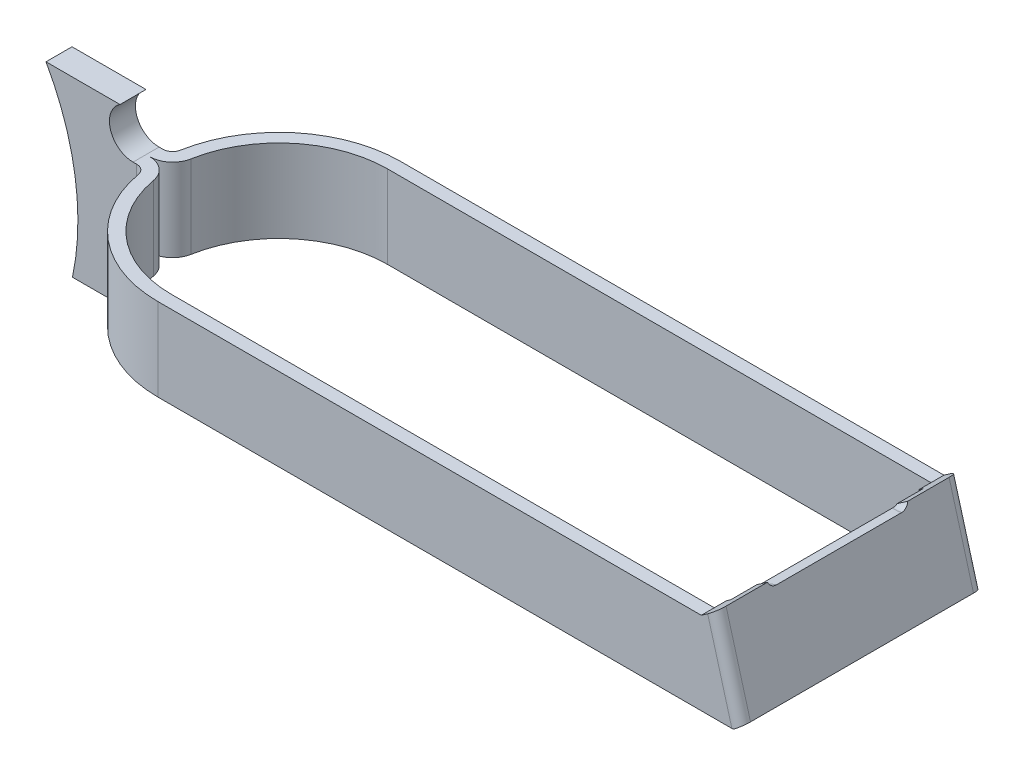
ISO-10303-21;
HEADER;
FILE_DESCRIPTION(('STEP AP214'),'2;1');
FILE_NAME('part.step','',(''),(''),'','','');
FILE_SCHEMA(('AUTOMOTIVE_DESIGN { 1 0 10303 214 1 1 1 1 }'));
ENDSEC;
DATA;
#1=APPLICATION_CONTEXT('core data for automotive mechanical design processes');
#2=APPLICATION_PROTOCOL_DEFINITION('international standard','automotive_design',2000,#1);
#3=PRODUCT_CONTEXT('',#1,'mechanical');
#4=PRODUCT('Part','Part','',(#3));
#5=PRODUCT_RELATED_PRODUCT_CATEGORY('part','',(#4));
#6=PRODUCT_DEFINITION_FORMATION('','',#4);
#7=PRODUCT_DEFINITION_CONTEXT('part definition',#1,'design');
#8=PRODUCT_DEFINITION('design','',#6,#7);
#9=PRODUCT_DEFINITION_SHAPE('','',#8);
#10=(LENGTH_UNIT() NAMED_UNIT(*) SI_UNIT(.MILLI.,.METRE.));
#11=(NAMED_UNIT(*) PLANE_ANGLE_UNIT() SI_UNIT($,.RADIAN.));
#12=(NAMED_UNIT(*) SI_UNIT($,.STERADIAN.) SOLID_ANGLE_UNIT());
#13=UNCERTAINTY_MEASURE_WITH_UNIT(LENGTH_MEASURE(1.E-05),#10,'distance_accuracy_value','');
#14=(GEOMETRIC_REPRESENTATION_CONTEXT(3) GLOBAL_UNCERTAINTY_ASSIGNED_CONTEXT((#13)) GLOBAL_UNIT_ASSIGNED_CONTEXT((#10,
#11,#12)) REPRESENTATION_CONTEXT('',''));
#15=CARTESIAN_POINT('',(0.,0.,0.));
#16=DIRECTION('',(0.,0.,1.));
#17=DIRECTION('',(1.,0.,0.));
#18=AXIS2_PLACEMENT_3D('',#15,#16,#17);
#19=CARTESIAN_POINT('',(20.32,-1.8034,-7.8232));
#20=DIRECTION('',(0.,0.,1.));
#21=DIRECTION('',(1.,0.,0.));
#22=AXIS2_PLACEMENT_3D('',#19,#20,#21);
#23=CYLINDRICAL_SURFACE('',#22,1.524);
#24=DIRECTION('',(0.,0.,1.));
#25=VECTOR('',#24,1.);
#26=CARTESIAN_POINT('',(20.32,-3.3274,-7.8232));
#27=LINE('',#26,#25);
#28=CARTESIAN_POINT('',(20.32,-3.3274,-0.8382));
#29=VERTEX_POINT('',#28);
#30=CARTESIAN_POINT('',(20.32,-3.3274,0.838200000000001));
#31=VERTEX_POINT('',#30);
#32=EDGE_CURVE('E265',#29,#31,#27,.T.);
#33=ORIENTED_EDGE('',*,*,#32,.F.);
#34=CARTESIAN_POINT('',(20.32,-1.8034,-0.838200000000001));
#35=DIRECTION('',(0.,0.,-1.));
#36=DIRECTION('',(-1.,0.,0.));
#37=AXIS2_PLACEMENT_3D('',#34,#35,#36);
#38=CIRCLE('',#37,1.524);
#39=CARTESIAN_POINT('',(19.7948139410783,-0.372751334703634,-0.838200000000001));
#40=VERTEX_POINT('',#39);
#41=EDGE_CURVE('E276',#29,#40,#38,.T.);
#42=ORIENTED_EDGE('',*,*,#41,.T.);
#43=CARTESIAN_POINT('',(20.32,-0.279399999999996,-1.116262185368));
#44=CARTESIAN_POINT('',(20.3006016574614,-0.279396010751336,-1.08765783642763));
#45=CARTESIAN_POINT('',(20.2788082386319,-0.279769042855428,-1.06067080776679));
#46=CARTESIAN_POINT('',(20.2312162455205,-0.281803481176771,-1.01064625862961));
#47=CARTESIAN_POINT('',(20.2054248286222,-0.283462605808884,-0.98760183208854));
#48=CARTESIAN_POINT('',(20.1504877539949,-0.288605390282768,-0.946025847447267));
#49=CARTESIAN_POINT('',(20.121334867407,-0.292093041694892,-0.927504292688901));
#50=CARTESIAN_POINT('',(20.0607038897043,-0.301307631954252,-0.895530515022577));
#51=CARTESIAN_POINT('',(20.0292259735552,-0.307034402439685,-0.882077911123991));
#52=CARTESIAN_POINT('',(19.9639886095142,-0.321179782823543,-0.860154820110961));
#53=CARTESIAN_POINT('',(19.9301885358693,-0.329677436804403,-0.85185445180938));
#54=CARTESIAN_POINT('',(19.8793687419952,-0.344381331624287,-0.843618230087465));
#55=CARTESIAN_POINT('',(19.8623767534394,-0.349620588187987,-0.841575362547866));
#56=CARTESIAN_POINT('',(19.8284932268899,-0.360723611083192,-0.838866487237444));
#57=CARTESIAN_POINT('',(19.8116016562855,-0.366587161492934,-0.838200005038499));
#58=CARTESIAN_POINT('',(19.7948139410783,-0.372751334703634,-0.8382));
#59=B_SPLINE_CURVE_WITH_KNOTS('',3,(#43,#44,#45,#46,#47,#48,#49,#50,#51,#52,#53,#54,#55,#56,#57,
#58),.UNSPECIFIED.,.F.,.F.,(4,2,2,2,2,2,2,4),(0.,0.103578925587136,0.206974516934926,
0.310596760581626,0.414211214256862,0.521086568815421,0.574726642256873,0.628348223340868),.UNSPECIFIED.);
#60=CARTESIAN_POINT('',(20.32,-0.279399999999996,-1.116262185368));
#61=VERTEX_POINT('',#60);
#62=EDGE_CURVE('E513',#61,#40,#59,.T.);
#63=ORIENTED_EDGE('',*,*,#62,.F.);
#64=DIRECTION('',(0.,0.,1.));
#65=VECTOR('',#64,1.);
#66=CARTESIAN_POINT('',(20.32,-0.279399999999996,-7.8232));
#67=LINE('',#66,#65);
#68=CARTESIAN_POINT('',(20.32,-0.279399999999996,-0.0967924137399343));
#69=VERTEX_POINT('',#68);
#70=EDGE_CURVE('E291',#61,#69,#67,.T.);
#71=ORIENTED_EDGE('',*,*,#70,.T.);
#72=CARTESIAN_POINT('',(20.32,-0.279399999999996,-0.0967924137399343));
#73=CARTESIAN_POINT('',(20.2909897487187,-0.27939898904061,-0.0857216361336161));
#74=CARTESIAN_POINT('',(20.2616419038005,-0.280229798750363,-0.0755773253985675));
#75=CARTESIAN_POINT('',(20.2024468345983,-0.283650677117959,-0.0571789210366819));
#76=CARTESIAN_POINT('',(20.1725993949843,-0.286241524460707,-0.0489256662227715));
#77=CARTESIAN_POINT('',(20.0839328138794,-0.296641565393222,-0.0273930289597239));
#78=CARTESIAN_POINT('',(20.0246932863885,-0.307071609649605,-0.0168508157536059));
#79=CARTESIAN_POINT('',(19.9372334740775,-0.327952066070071,-0.00661209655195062));
#80=CARTESIAN_POINT('',(19.9086211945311,-0.335672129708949,-0.00412625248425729));
#81=CARTESIAN_POINT('',(19.8515099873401,-0.352886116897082,-0.000811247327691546));
#82=CARTESIAN_POINT('',(19.8230153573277,-0.362397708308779,3.57429650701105E-07));
#83=CARTESIAN_POINT('',(19.7948139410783,-0.372751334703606,0.));
#84=B_SPLINE_CURVE_WITH_KNOTS('',3,(#72,#73,#74,#75,#76,#77,#78,#79,#80,#81,#82,#83),
.UNSPECIFIED.,.F.,.F.,(4,2,2,2,2,4),(0.,0.0930934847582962,0.186228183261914,0.368392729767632,
0.457531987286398,0.547601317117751),.UNSPECIFIED.);
#85=CARTESIAN_POINT('',(19.7948139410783,-0.372751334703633,0.));
#86=VERTEX_POINT('',#85);
#87=EDGE_CURVE('E484',#69,#86,#84,.T.);
#88=ORIENTED_EDGE('',*,*,#87,.T.);
#89=CARTESIAN_POINT('',(20.32,-0.279399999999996,0.0967924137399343));
#90=CARTESIAN_POINT('',(20.2909897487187,-0.27939898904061,0.0857216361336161));
#91=CARTESIAN_POINT('',(20.2616419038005,-0.280229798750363,0.0755773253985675));
#92=CARTESIAN_POINT('',(20.2024468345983,-0.283650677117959,0.0571789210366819));
#93=CARTESIAN_POINT('',(20.1725993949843,-0.286241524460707,0.0489256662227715));
#94=CARTESIAN_POINT('',(20.0839328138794,-0.296641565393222,0.0273930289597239));
#95=CARTESIAN_POINT('',(20.0246932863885,-0.307071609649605,0.0168508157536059));
#96=CARTESIAN_POINT('',(19.9372334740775,-0.327952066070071,0.00661209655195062));
#97=CARTESIAN_POINT('',(19.9086211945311,-0.335672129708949,0.00412625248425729));
#98=CARTESIAN_POINT('',(19.8515099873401,-0.352886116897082,0.000811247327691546));
#99=CARTESIAN_POINT('',(19.8230153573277,-0.362397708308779,-3.57429650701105E-07));
#100=CARTESIAN_POINT('',(19.7948139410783,-0.372751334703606,0.));
#101=B_SPLINE_CURVE_WITH_KNOTS('',3,(#89,#90,#91,#92,#93,#94,#95,#96,#97,#98,#99,#100),
.UNSPECIFIED.,.F.,.F.,(4,2,2,2,2,4),(0.,0.0930934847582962,0.186228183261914,0.368392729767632,
0.457531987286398,0.547601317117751),.UNSPECIFIED.);
#102=CARTESIAN_POINT('',(20.32,-0.279399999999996,0.0967924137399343));
#103=VERTEX_POINT('',#102);
#104=EDGE_CURVE('E474',#103,#86,#101,.T.);
#105=ORIENTED_EDGE('',*,*,#104,.F.);
#106=CARTESIAN_POINT('',(20.32,-0.279399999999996,1.116262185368));
#107=VERTEX_POINT('',#106);
#108=EDGE_CURVE('E288',#103,#107,#67,.T.);
#109=ORIENTED_EDGE('',*,*,#108,.T.);
#110=CARTESIAN_POINT('',(20.32,-0.279399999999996,1.116262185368));
#111=CARTESIAN_POINT('',(20.3006016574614,-0.279396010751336,1.08765783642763));
#112=CARTESIAN_POINT('',(20.2788082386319,-0.279769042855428,1.06067080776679));
#113=CARTESIAN_POINT('',(20.2312162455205,-0.281803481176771,1.01064625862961));
#114=CARTESIAN_POINT('',(20.2054248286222,-0.283462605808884,0.98760183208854));
#115=CARTESIAN_POINT('',(20.1504877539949,-0.288605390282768,0.946025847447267));
#116=CARTESIAN_POINT('',(20.121334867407,-0.292093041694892,0.927504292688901));
#117=CARTESIAN_POINT('',(20.0607038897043,-0.301307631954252,0.895530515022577));
#118=CARTESIAN_POINT('',(20.0292259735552,-0.307034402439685,0.882077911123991));
#119=CARTESIAN_POINT('',(19.9639886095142,-0.321179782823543,0.860154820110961));
#120=CARTESIAN_POINT('',(19.9301885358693,-0.329677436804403,0.85185445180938));
#121=CARTESIAN_POINT('',(19.8793687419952,-0.344381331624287,0.843618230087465));
#122=CARTESIAN_POINT('',(19.8623767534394,-0.349620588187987,0.841575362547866));
#123=CARTESIAN_POINT('',(19.8284932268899,-0.360723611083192,0.838866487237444));
#124=CARTESIAN_POINT('',(19.8116016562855,-0.366587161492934,0.838200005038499));
#125=CARTESIAN_POINT('',(19.7948139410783,-0.372751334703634,0.8382));
#126=B_SPLINE_CURVE_WITH_KNOTS('',3,(#110,#111,#112,#113,#114,#115,#116,#117,#118,#119,#120,
#121,#122,#123,#124,#125),.UNSPECIFIED.,.F.,.F.,(4,2,2,2,2,2,2,4),(0.,0.103578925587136,
0.206974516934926,0.310596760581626,0.414211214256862,0.521086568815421,0.574726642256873,
0.628348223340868),.UNSPECIFIED.);
#127=CARTESIAN_POINT('',(19.7948139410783,-0.372751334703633,0.8382));
#128=VERTEX_POINT('',#127);
#129=EDGE_CURVE('E491',#107,#128,#126,.T.);
#130=ORIENTED_EDGE('',*,*,#129,.T.);
#131=CARTESIAN_POINT('',(20.32,-1.8034,0.838200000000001));
#132=DIRECTION('',(0.,0.,-1.));
#133=DIRECTION('',(-1.,0.,0.));
#134=AXIS2_PLACEMENT_3D('',#131,#132,#133);
#135=CIRCLE('',#134,1.524);
#136=EDGE_CURVE('E287',#31,#128,#135,.T.);
#137=ORIENTED_EDGE('',*,*,#136,.F.);
#138=EDGE_LOOP('',(#33,#42,#63,#71,#88,#105,#109,#130,#137));
#139=FACE_BOUND('',#138,.T.);
#140=ADVANCED_FACE('F33',(#139),#23,.F.);
#141=CARTESIAN_POINT('',(15.6522334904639,-3.3274,-7.8232));
#142=DIRECTION('',(0.,-1.,0.));
#143=DIRECTION('',(0.,0.,-1.));
#144=AXIS2_PLACEMENT_3D('',#141,#142,#143);
#145=PLANE('',#144);
#146=DIRECTION('',(-1.,0.,0.));
#147=VECTOR('',#146,1.);
#148=CARTESIAN_POINT('',(19.7948139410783,-3.3274,-0.8382));
#149=LINE('',#148,#147);
#150=CARTESIAN_POINT('',(15.6522334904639,-3.3274,-0.838200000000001));
#151=VERTEX_POINT('',#150);
#152=EDGE_CURVE('E260',#29,#151,#149,.T.);
#153=ORIENTED_EDGE('',*,*,#152,.F.);
#154=ORIENTED_EDGE('',*,*,#32,.T.);
#155=DIRECTION('',(-1.,0.,0.));
#156=VECTOR('',#155,1.);
#157=CARTESIAN_POINT('',(19.7948139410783,-3.3274,0.8382));
#158=LINE('',#157,#156);
#159=CARTESIAN_POINT('',(15.6522334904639,-3.3274,0.838200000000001));
#160=VERTEX_POINT('',#159);
#161=EDGE_CURVE('E271',#31,#160,#158,.T.);
#162=ORIENTED_EDGE('',*,*,#161,.T.);
#163=DIRECTION('',(0.,0.,1.));
#164=VECTOR('',#163,1.);
#165=CARTESIAN_POINT('',(15.6522334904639,-3.32739999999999,-7.8232));
#166=LINE('',#165,#164);
#167=EDGE_CURVE('E268',#151,#160,#166,.T.);
#168=ORIENTED_EDGE('',*,*,#167,.F.);
#169=EDGE_LOOP('',(#153,#154,#162,#168));
#170=FACE_BOUND('',#169,.T.);
#171=ADVANCED_FACE('F262',(#170),#145,.T.);
#172=CARTESIAN_POINT('',(63.1716035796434,5.05460000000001,-7.8232));
#173=DIRECTION('',(0.574317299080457,-0.8186327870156,0.));
#174=DIRECTION('',(0.8186327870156,0.574317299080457,0.));
#175=AXIS2_PLACEMENT_3D('',#172,#173,#174);
#176=PLANE('',#175);
#177=DIRECTION('',(0.,0.,1.));
#178=VECTOR('',#177,1.);
#179=CARTESIAN_POINT('',(63.4488396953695,5.24909684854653,-6.2103));
#180=LINE('',#179,#178);
#181=CARTESIAN_POINT('',(63.4488396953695,5.24909684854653,-6.2103));
#182=VERTEX_POINT('',#181);
#183=CARTESIAN_POINT('',(63.4488396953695,5.24909684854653,-4.5212));
#184=VERTEX_POINT('',#183);
#185=EDGE_CURVE('E527',#182,#184,#180,.T.);
#186=ORIENTED_EDGE('',*,*,#185,.T.);
#187=DIRECTION('',(0.8186327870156,0.574317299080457,0.));
#188=VECTOR('',#187,1.);
#189=CARTESIAN_POINT('',(63.1716035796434,5.05460000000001,-4.5212));
#190=LINE('',#189,#188);
#191=CARTESIAN_POINT('',(64.135017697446,5.73048960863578,-4.5212));
#192=VERTEX_POINT('',#191);
#193=EDGE_CURVE('E714',#184,#192,#190,.T.);
#194=ORIENTED_EDGE('',*,*,#193,.T.);
#195=DIRECTION('',(0.,0.,1.));
#196=VECTOR('',#195,1.);
#197=CARTESIAN_POINT('',(64.135017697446,5.73048960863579,-7.8232));
#198=LINE('',#197,#196);
#199=CARTESIAN_POINT('',(64.135017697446,5.73048960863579,-7.1882));
#200=VERTEX_POINT('',#199);
#201=EDGE_CURVE('E304',#200,#192,#198,.T.);
#202=ORIENTED_EDGE('',*,*,#201,.F.);
#203=CARTESIAN_POINT('',(63.583377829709,5.34348297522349,-7.1882));
#204=DIRECTION('',(0.574317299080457,-0.8186327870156,0.));
#205=DIRECTION('',(0.8186327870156,0.574317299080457,0.));
#206=AXIS2_PLACEMENT_3D('',#203,#204,#205);
#207=ELLIPSE('',#206,0.673855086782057,0.635);
#208=CARTESIAN_POINT('',(63.583377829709,5.34348297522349,-7.8232));
#209=VERTEX_POINT('',#208);
#210=EDGE_CURVE('E359',#200,#209,#207,.F.);
#211=ORIENTED_EDGE('',*,*,#210,.T.);
#212=DIRECTION('',(0.8186327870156,0.574317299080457,0.));
#213=VECTOR('',#212,1.);
#214=CARTESIAN_POINT('',(63.1716035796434,5.05460000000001,-7.8232));
#215=LINE('',#214,#213);
#216=CARTESIAN_POINT('',(63.1716035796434,5.05460000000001,-7.8232));
#217=VERTEX_POINT('',#216);
#218=EDGE_CURVE('E591',#217,#209,#215,.T.);
#219=ORIENTED_EDGE('',*,*,#218,.F.);
#220=DIRECTION('',(0.,0.,1.));
#221=VECTOR('',#220,1.);
#222=CARTESIAN_POINT('',(63.1716035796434,5.05460000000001,-7.8232));
#223=LINE('',#222,#221);
#224=CARTESIAN_POINT('',(63.1716035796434,5.05460000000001,-6.98499999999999));
#225=VERTEX_POINT('',#224);
#226=EDGE_CURVE('E604',#217,#225,#223,.T.);
#227=ORIENTED_EDGE('',*,*,#226,.T.);
#228=CARTESIAN_POINT('',(63.1716035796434,5.0546,-6.2103));
#229=VERTEX_POINT('',#228);
#230=EDGE_CURVE('E608',#225,#229,#223,.T.);
#231=ORIENTED_EDGE('',*,*,#230,.T.);
#232=DIRECTION('',(-0.818632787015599,-0.574317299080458,0.));
#233=VECTOR('',#232,1.);
#234=CARTESIAN_POINT('',(63.4488396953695,5.24909684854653,-6.2103));
#235=LINE('',#234,#233);
#236=EDGE_CURVE('E521',#182,#229,#235,.T.);
#237=ORIENTED_EDGE('',*,*,#236,.F.);
#238=EDGE_LOOP('',(#186,#194,#202,#211,#219,#227,#231,#237));
#239=FACE_BOUND('',#238,.T.);
#240=ADVANCED_FACE('F449',(#239),#176,.F.);
#241=CARTESIAN_POINT('',(63.1716035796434,5.05460000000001,-7.8232));
#242=DIRECTION('',(0.,1.,0.));
#243=DIRECTION('',(-1.,0.,0.));
#244=AXIS2_PLACEMENT_3D('',#241,#242,#243);
#245=PLANE('',#244);
#246=DIRECTION('',(-1.,0.,0.));
#247=VECTOR('',#246,1.);
#248=CARTESIAN_POINT('',(63.1716035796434,5.05460000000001,-7.8232));
#249=LINE('',#248,#247);
#250=CARTESIAN_POINT('',(28.1450035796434,5.0546,-7.8232));
#251=VERTEX_POINT('',#250);
#252=EDGE_CURVE('E597',#217,#251,#249,.T.);
#253=ORIENTED_EDGE('',*,*,#252,.T.);
#254=CARTESIAN_POINT('',(28.1450035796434,5.05460000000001,0.0254000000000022));
#255=DIRECTION('',(0.,1.,0.));
#256=DIRECTION('',(-1.,0.,0.));
#257=AXIS2_PLACEMENT_3D('',#254,#255,#256);
#258=CIRCLE('',#257,7.8486);
#259=CARTESIAN_POINT('',(20.4198281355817,5.0546,-1.36102934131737));
#260=VERTEX_POINT('',#259);
#261=EDGE_CURVE('E630',#251,#260,#258,.T.);
#262=ORIENTED_EDGE('',*,*,#261,.T.);
#263=CARTESIAN_POINT('',(19.7948139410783,5.0546,-1.47320000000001));
#264=DIRECTION('',(0.,1.,0.));
#265=DIRECTION('',(-1.,0.,0.));
#266=AXIS2_PLACEMENT_3D('',#263,#264,#265);
#267=CIRCLE('',#266,0.635000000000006);
#268=CARTESIAN_POINT('',(19.7948139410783,5.0546,-0.8382));
#269=VERTEX_POINT('',#268);
#270=EDGE_CURVE('E518',#269,#260,#267,.T.);
#271=ORIENTED_EDGE('',*,*,#270,.F.);
#272=DIRECTION('',(-1.,0.,0.));
#273=VECTOR('',#272,1.);
#274=CARTESIAN_POINT('',(63.1716035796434,5.05460000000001,-0.838199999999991));
#275=LINE('',#274,#273);
#276=CARTESIAN_POINT('',(19.558,5.0546,-0.838200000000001));
#277=VERTEX_POINT('',#276);
#278=EDGE_CURVE('E628',#269,#277,#275,.T.);
#279=ORIENTED_EDGE('',*,*,#278,.T.);
#280=DIRECTION('',(0.,0.,1.));
#281=VECTOR('',#280,1.);
#282=CARTESIAN_POINT('',(19.558,5.0546,-7.8232));
#283=LINE('',#282,#281);
#284=CARTESIAN_POINT('',(19.558,5.0546,0.838200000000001));
#285=VERTEX_POINT('',#284);
#286=EDGE_CURVE('E607',#277,#285,#283,.T.);
#287=ORIENTED_EDGE('',*,*,#286,.T.);
#288=DIRECTION('',(-1.,0.,0.));
#289=VECTOR('',#288,1.);
#290=CARTESIAN_POINT('',(63.1716035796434,5.05460000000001,0.83819999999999));
#291=LINE('',#290,#289);
#292=CARTESIAN_POINT('',(19.7948139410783,5.0546,0.8382));
#293=VERTEX_POINT('',#292);
#294=EDGE_CURVE('E626',#293,#285,#291,.T.);
#295=ORIENTED_EDGE('',*,*,#294,.F.);
#296=CARTESIAN_POINT('',(19.7948139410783,5.0546,1.47320000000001));
#297=DIRECTION('',(0.,1.,0.));
#298=DIRECTION('',(-1.,0.,0.));
#299=AXIS2_PLACEMENT_3D('',#296,#297,#298);
#300=CIRCLE('',#299,0.635000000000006);
#301=CARTESIAN_POINT('',(20.4198281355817,5.0546,1.36102934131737));
#302=VERTEX_POINT('',#301);
#303=EDGE_CURVE('E498',#293,#302,#300,.F.);
#304=ORIENTED_EDGE('',*,*,#303,.T.);
#305=CARTESIAN_POINT('',(28.1450035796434,5.05460000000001,-0.0254000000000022));
#306=DIRECTION('',(0.,1.,0.));
#307=DIRECTION('',(-1.,0.,0.));
#308=AXIS2_PLACEMENT_3D('',#305,#306,#307);
#309=CIRCLE('',#308,7.8486);
#310=CARTESIAN_POINT('',(28.1450035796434,5.05460000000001,7.8232));
#311=VERTEX_POINT('',#310);
#312=EDGE_CURVE('E651',#311,#302,#309,.F.);
#313=ORIENTED_EDGE('',*,*,#312,.F.);
#314=DIRECTION('',(-1.,0.,0.));
#315=VECTOR('',#314,1.);
#316=CARTESIAN_POINT('',(63.1716035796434,5.05460000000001,7.8232));
#317=LINE('',#316,#315);
#318=CARTESIAN_POINT('',(63.1716035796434,5.05460000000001,7.8232));
#319=VERTEX_POINT('',#318);
#320=EDGE_CURVE('E595',#319,#311,#317,.T.);
#321=ORIENTED_EDGE('',*,*,#320,.F.);
#322=CARTESIAN_POINT('',(63.1716035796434,5.05460000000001,6.98499999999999));
#323=VERTEX_POINT('',#322);
#324=EDGE_CURVE('E599',#323,#319,#223,.T.);
#325=ORIENTED_EDGE('',*,*,#324,.F.);
#326=DIRECTION('',(1.,0.,0.));
#327=VECTOR('',#326,1.);
#328=CARTESIAN_POINT('',(63.1716035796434,5.05460000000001,6.98499999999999));
#329=LINE('',#328,#327);
#330=CARTESIAN_POINT('',(28.1450035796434,5.05460000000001,6.985));
#331=VERTEX_POINT('',#330);
#332=EDGE_CURVE('E319',#331,#323,#329,.T.);
#333=ORIENTED_EDGE('',*,*,#332,.F.);
#334=CARTESIAN_POINT('',(28.1450035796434,5.0546,-0.0254000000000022));
#335=DIRECTION('',(0.,1.,0.));
#336=DIRECTION('',(-1.,0.,0.));
#337=AXIS2_PLACEMENT_3D('',#334,#335,#336);
#338=CIRCLE('',#337,7.0104);
#339=CARTESIAN_POINT('',(21.2448468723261,5.0546,1.21296407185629));
#340=VERTEX_POINT('',#339);
#341=EDGE_CURVE('E317',#340,#331,#338,.T.);
#342=ORIENTED_EDGE('',*,*,#341,.F.);
#343=CARTESIAN_POINT('',(19.7948139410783,5.0546,1.47320000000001));
#344=DIRECTION('',(0.,1.,0.));
#345=DIRECTION('',(-1.,0.,0.));
#346=AXIS2_PLACEMENT_3D('',#343,#344,#345);
#347=CIRCLE('',#346,1.4732);
#348=CARTESIAN_POINT('',(19.7948139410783,5.0546,0.));
#349=VERTEX_POINT('',#348);
#350=EDGE_CURVE('E315',#349,#340,#347,.F.);
#351=ORIENTED_EDGE('',*,*,#350,.F.);
#352=CARTESIAN_POINT('',(19.7948139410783,5.0546,-1.47320000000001));
#353=DIRECTION('',(0.,1.,0.));
#354=DIRECTION('',(-1.,0.,0.));
#355=AXIS2_PLACEMENT_3D('',#352,#353,#354);
#356=CIRCLE('',#355,1.4732);
#357=CARTESIAN_POINT('',(21.2448468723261,5.0546,-1.21296407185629));
#358=VERTEX_POINT('',#357);
#359=EDGE_CURVE('E312',#349,#358,#356,.T.);
#360=ORIENTED_EDGE('',*,*,#359,.T.);
#361=CARTESIAN_POINT('',(28.1450035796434,5.0546,0.0254000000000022));
#362=DIRECTION('',(0.,1.,0.));
#363=DIRECTION('',(-1.,0.,0.));
#364=AXIS2_PLACEMENT_3D('',#361,#362,#363);
#365=CIRCLE('',#364,7.0104);
#366=CARTESIAN_POINT('',(28.1450035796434,5.0546,-6.985));
#367=VERTEX_POINT('',#366);
#368=EDGE_CURVE('E306',#358,#367,#365,.F.);
#369=ORIENTED_EDGE('',*,*,#368,.T.);
#370=DIRECTION('',(1.,0.,0.));
#371=VECTOR('',#370,1.);
#372=CARTESIAN_POINT('',(63.1716035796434,5.05460000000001,-6.98499999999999));
#373=LINE('',#372,#371);
#374=EDGE_CURVE('E309',#367,#225,#373,.T.);
#375=ORIENTED_EDGE('',*,*,#374,.T.);
#376=ORIENTED_EDGE('',*,*,#226,.F.);
#377=EDGE_LOOP('',(#253,#262,#271,#279,#287,#295,#304,#313,#321,#325,#333,#342,#351,#360,#369,
#375,#376));
#378=FACE_BOUND('',#377,.T.);
#379=ADVANCED_FACE('F639',(#378),#245,.T.);
#380=CARTESIAN_POINT('',(65.2374104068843,-0.279399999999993,-7.8232));
#381=DIRECTION('',(0.,1.,0.));
#382=DIRECTION('',(-1.,0.,0.));
#383=AXIS2_PLACEMENT_3D('',#380,#381,#382);
#384=PLANE('',#383);
#385=DIRECTION('',(-1.,0.,0.));
#386=VECTOR('',#385,1.);
#387=CARTESIAN_POINT('',(65.2374104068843,-0.279399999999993,-7.8232));
#388=LINE('',#387,#386);
#389=CARTESIAN_POINT('',(65.1427412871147,-0.279399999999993,-7.8232));
#390=VERTEX_POINT('',#389);
#391=CARTESIAN_POINT('',(28.1450035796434,-0.279399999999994,-7.8232));
#392=VERTEX_POINT('',#391);
#393=EDGE_CURVE('E594',#390,#392,#388,.T.);
#394=ORIENTED_EDGE('',*,*,#393,.F.);
#395=CARTESIAN_POINT('',(65.1427412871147,-0.279399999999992,-7.1882));
#396=DIRECTION('',(0.,1.,0.));
#397=DIRECTION('',(-1.,0.,0.));
#398=AXIS2_PLACEMENT_3D('',#395,#396,#397);
#399=ELLIPSE('',#398,0.658966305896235,0.635);
#400=CARTESIAN_POINT('',(65.2374104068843,-0.279399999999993,-7.8166129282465));
#401=VERTEX_POINT('',#400);
#402=EDGE_CURVE('E345',#390,#401,#399,.F.);
#403=ORIENTED_EDGE('',*,*,#402,.T.);
#404=DIRECTION('',(0.,0.,1.));
#405=VECTOR('',#404,1.);
#406=CARTESIAN_POINT('',(65.2374104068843,-0.279399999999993,-7.8232));
#407=LINE('',#406,#405);
#408=CARTESIAN_POINT('',(65.2374104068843,-0.279399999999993,7.81661292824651));
#409=VERTEX_POINT('',#408);
#410=EDGE_CURVE('E297',#401,#409,#407,.T.);
#411=ORIENTED_EDGE('',*,*,#410,.T.);
#412=CARTESIAN_POINT('',(65.1427412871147,-0.279399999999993,7.1882));
#413=DIRECTION('',(0.,1.,0.));
#414=DIRECTION('',(1.,0.,0.));
#415=AXIS2_PLACEMENT_3D('',#412,#413,#414);
#416=ELLIPSE('',#415,0.658966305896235,0.635);
#417=CARTESIAN_POINT('',(65.1427412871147,-0.279399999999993,7.8232));
#418=VERTEX_POINT('',#417);
#419=EDGE_CURVE('E343',#409,#418,#416,.F.);
#420=ORIENTED_EDGE('',*,*,#419,.T.);
#421=DIRECTION('',(-1.,0.,0.));
#422=VECTOR('',#421,1.);
#423=CARTESIAN_POINT('',(65.2374104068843,-0.279399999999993,7.8232));
#424=LINE('',#423,#422);
#425=CARTESIAN_POINT('',(28.1450035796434,-0.279399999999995,7.8232));
#426=VERTEX_POINT('',#425);
#427=EDGE_CURVE('E588',#418,#426,#424,.T.);
#428=ORIENTED_EDGE('',*,*,#427,.T.);
#429=CARTESIAN_POINT('',(28.1450035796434,-0.279399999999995,-0.0254000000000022));
#430=DIRECTION('',(0.,1.,0.));
#431=DIRECTION('',(-1.,0.,0.));
#432=AXIS2_PLACEMENT_3D('',#429,#430,#431);
#433=CIRCLE('',#432,7.8486);
#434=CARTESIAN_POINT('',(20.4198281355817,-0.279399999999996,1.36102934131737));
#435=VERTEX_POINT('',#434);
#436=EDGE_CURVE('E727',#426,#435,#433,.F.);
#437=ORIENTED_EDGE('',*,*,#436,.T.);
#438=CARTESIAN_POINT('',(19.7948139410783,-0.279399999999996,1.47320000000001));
#439=DIRECTION('',(0.,1.,0.));
#440=DIRECTION('',(-1.,0.,0.));
#441=AXIS2_PLACEMENT_3D('',#438,#439,#440);
#442=CIRCLE('',#441,0.635000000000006);
#443=EDGE_CURVE('E282',#107,#435,#442,.F.);
#444=ORIENTED_EDGE('',*,*,#443,.F.);
#445=ORIENTED_EDGE('',*,*,#108,.F.);
#446=CARTESIAN_POINT('',(19.7948139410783,-0.279399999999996,1.47320000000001));
#447=DIRECTION('',(0.,1.,0.));
#448=DIRECTION('',(-1.,0.,0.));
#449=AXIS2_PLACEMENT_3D('',#446,#447,#448);
#450=CIRCLE('',#449,1.4732);
#451=CARTESIAN_POINT('',(21.2448468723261,-0.279399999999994,1.21296407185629));
#452=VERTEX_POINT('',#451);
#453=EDGE_CURVE('E575',#103,#452,#450,.F.);
#454=ORIENTED_EDGE('',*,*,#453,.T.);
#455=CARTESIAN_POINT('',(28.1450035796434,-0.279399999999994,-0.0254000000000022));
#456=DIRECTION('',(0.,1.,0.));
#457=DIRECTION('',(-1.,0.,0.));
#458=AXIS2_PLACEMENT_3D('',#455,#456,#457);
#459=CIRCLE('',#458,7.0104);
#460=CARTESIAN_POINT('',(28.1450035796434,-0.279399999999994,6.985));
#461=VERTEX_POINT('',#460);
#462=EDGE_CURVE('E571',#452,#461,#459,.T.);
#463=ORIENTED_EDGE('',*,*,#462,.T.);
#464=DIRECTION('',(1.,0.,0.));
#465=VECTOR('',#464,1.);
#466=CARTESIAN_POINT('',(65.2374104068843,-0.279399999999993,6.98499999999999));
#467=LINE('',#466,#465);
#468=CARTESIAN_POINT('',(63.1716035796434,-0.279399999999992,6.98499999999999));
#469=VERTEX_POINT('',#468);
#470=EDGE_CURVE('E569',#461,#469,#467,.T.);
#471=ORIENTED_EDGE('',*,*,#470,.T.);
#472=DIRECTION('',(0.,0.,1.));
#473=VECTOR('',#472,1.);
#474=CARTESIAN_POINT('',(63.1716035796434,-0.279399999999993,-7.8232));
#475=LINE('',#474,#473);
#476=CARTESIAN_POINT('',(63.1716035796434,-0.279399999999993,6.2103));
#477=VERTEX_POINT('',#476);
#478=EDGE_CURVE('E565',#477,#469,#475,.T.);
#479=ORIENTED_EDGE('',*,*,#478,.F.);
#480=DIRECTION('',(-1.,0.,0.));
#481=VECTOR('',#480,1.);
#482=CARTESIAN_POINT('',(65.2374104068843,-0.279399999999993,6.2103));
#483=LINE('',#482,#481);
#484=CARTESIAN_POINT('',(64.982027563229,-0.279399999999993,6.2103));
#485=VERTEX_POINT('',#484);
#486=EDGE_CURVE('E533',#485,#477,#483,.T.);
#487=ORIENTED_EDGE('',*,*,#486,.F.);
#488=DIRECTION('',(0.,0.,1.));
#489=VECTOR('',#488,1.);
#490=CARTESIAN_POINT('',(64.982027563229,-0.279399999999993,-7.8232));
#491=LINE('',#490,#489);
#492=CARTESIAN_POINT('',(64.982027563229,-0.279399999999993,-6.2103));
#493=VERTEX_POINT('',#492);
#494=EDGE_CURVE('E327',#493,#485,#491,.T.);
#495=ORIENTED_EDGE('',*,*,#494,.F.);
#496=DIRECTION('',(-1.,0.,0.));
#497=VECTOR('',#496,1.);
#498=CARTESIAN_POINT('',(65.2374104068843,-0.279399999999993,-6.2103));
#499=LINE('',#498,#497);
#500=CARTESIAN_POINT('',(63.1716035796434,-0.279399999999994,-6.2103));
#501=VERTEX_POINT('',#500);
#502=EDGE_CURVE('E537',#493,#501,#499,.T.);
#503=ORIENTED_EDGE('',*,*,#502,.T.);
#504=CARTESIAN_POINT('',(63.1716035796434,-0.279399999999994,-6.98499999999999));
#505=VERTEX_POINT('',#504);
#506=EDGE_CURVE('E566',#505,#501,#475,.T.);
#507=ORIENTED_EDGE('',*,*,#506,.F.);
#508=DIRECTION('',(1.,0.,0.));
#509=VECTOR('',#508,1.);
#510=CARTESIAN_POINT('',(65.2374104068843,-0.279399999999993,-6.98499999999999));
#511=LINE('',#510,#509);
#512=CARTESIAN_POINT('',(28.1450035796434,-0.279399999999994,-6.985));
#513=VERTEX_POINT('',#512);
#514=EDGE_CURVE('E563',#513,#505,#511,.T.);
#515=ORIENTED_EDGE('',*,*,#514,.F.);
#516=CARTESIAN_POINT('',(28.1450035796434,-0.279399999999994,0.0254000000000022));
#517=DIRECTION('',(0.,1.,0.));
#518=DIRECTION('',(-1.,0.,0.));
#519=AXIS2_PLACEMENT_3D('',#516,#517,#518);
#520=CIRCLE('',#519,7.0104);
#521=CARTESIAN_POINT('',(21.2448468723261,-0.279399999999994,-1.21296407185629));
#522=VERTEX_POINT('',#521);
#523=EDGE_CURVE('E561',#522,#513,#520,.F.);
#524=ORIENTED_EDGE('',*,*,#523,.F.);
#525=CARTESIAN_POINT('',(19.7948139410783,-0.279399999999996,-1.47320000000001));
#526=DIRECTION('',(0.,1.,0.));
#527=DIRECTION('',(-1.,0.,0.));
#528=AXIS2_PLACEMENT_3D('',#525,#526,#527);
#529=CIRCLE('',#528,1.4732);
#530=EDGE_CURVE('E581',#69,#522,#529,.T.);
#531=ORIENTED_EDGE('',*,*,#530,.F.);
#532=ORIENTED_EDGE('',*,*,#70,.F.);
#533=CARTESIAN_POINT('',(19.7948139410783,-0.279399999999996,-1.47320000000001));
#534=DIRECTION('',(0.,1.,0.));
#535=DIRECTION('',(-1.,0.,0.));
#536=AXIS2_PLACEMENT_3D('',#533,#534,#535);
#537=CIRCLE('',#536,0.635000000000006);
#538=CARTESIAN_POINT('',(20.4198281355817,-0.279399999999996,-1.36102934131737));
#539=VERTEX_POINT('',#538);
#540=EDGE_CURVE('E519',#61,#539,#537,.T.);
#541=ORIENTED_EDGE('',*,*,#540,.T.);
#542=CARTESIAN_POINT('',(28.1450035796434,-0.279399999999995,0.0254000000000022));
#543=DIRECTION('',(0.,1.,0.));
#544=DIRECTION('',(-1.,0.,0.));
#545=AXIS2_PLACEMENT_3D('',#542,#543,#544);
#546=CIRCLE('',#545,7.8486);
#547=EDGE_CURVE('E657',#392,#539,#546,.T.);
#548=ORIENTED_EDGE('',*,*,#547,.F.);
#549=EDGE_LOOP('',(#394,#403,#411,#420,#428,#437,#444,#445,#454,#463,#471,#479,#487,#495,#503,
#507,#515,#524,#531,#532,#541,#548));
#550=FACE_BOUND('',#549,.T.);
#551=ADVANCED_FACE('F470',(#550),#384,.F.);
#552=CARTESIAN_POINT('',(0.,0.,-7.8232));
#553=DIRECTION('',(0.,0.,1.));
#554=DIRECTION('',(1.,0.,0.));
#555=AXIS2_PLACEMENT_3D('',#552,#553,#554);
#556=CYLINDRICAL_SURFACE('',#555,16.002);
#557=DIRECTION('',(0.,0.,1.));
#558=VECTOR('',#557,1.);
#559=CARTESIAN_POINT('',(13.9450163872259,7.8486,-7.8232));
#560=LINE('',#559,#558);
#561=CARTESIAN_POINT('',(13.9450163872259,7.8486,-0.838200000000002));
#562=VERTEX_POINT('',#561);
#563=CARTESIAN_POINT('',(13.9450163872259,7.8486,0.838200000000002));
#564=VERTEX_POINT('',#563);
#565=EDGE_CURVE('E293',#562,#564,#560,.T.);
#566=ORIENTED_EDGE('',*,*,#565,.F.);
#567=CARTESIAN_POINT('',(0.,0.,-0.838200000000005));
#568=DIRECTION('',(0.,0.,-1.));
#569=DIRECTION('',(-1.,0.,0.));
#570=AXIS2_PLACEMENT_3D('',#567,#568,#569);
#571=CIRCLE('',#570,16.002);
#572=EDGE_CURVE('E283',#562,#151,#571,.T.);
#573=ORIENTED_EDGE('',*,*,#572,.T.);
#574=ORIENTED_EDGE('',*,*,#167,.T.);
#575=CARTESIAN_POINT('',(0.,0.,0.838200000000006));
#576=DIRECTION('',(0.,0.,-1.));
#577=DIRECTION('',(-1.,0.,0.));
#578=AXIS2_PLACEMENT_3D('',#575,#576,#577);
#579=CIRCLE('',#578,16.002);
#580=EDGE_CURVE('E625',#564,#160,#579,.T.);
#581=ORIENTED_EDGE('',*,*,#580,.F.);
#582=EDGE_LOOP('',(#566,#573,#574,#581));
#583=FACE_BOUND('',#582,.T.);
#584=ADVANCED_FACE('F624',(#583),#556,.F.);
#585=CARTESIAN_POINT('',(18.7155773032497,7.8486,-7.8232));
#586=DIRECTION('',(0.,1.,0.));
#587=DIRECTION('',(0.,0.,1.));
#588=AXIS2_PLACEMENT_3D('',#585,#586,#587);
#589=PLANE('',#588);
#590=DIRECTION('',(0.,0.,1.));
#591=VECTOR('',#590,1.);
#592=CARTESIAN_POINT('',(18.7155773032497,7.8486,-7.8232));
#593=LINE('',#592,#591);
#594=CARTESIAN_POINT('',(18.7155773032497,7.8486,-0.838200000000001));
#595=VERTEX_POINT('',#594);
#596=CARTESIAN_POINT('',(18.7155773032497,7.8486,0.838200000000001));
#597=VERTEX_POINT('',#596);
#598=EDGE_CURVE('E612',#595,#597,#593,.T.);
#599=ORIENTED_EDGE('',*,*,#598,.F.);
#600=DIRECTION('',(-1.,0.,0.));
#601=VECTOR('',#600,1.);
#602=CARTESIAN_POINT('',(19.7948139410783,7.8486,-0.8382));
#603=LINE('',#602,#601);
#604=EDGE_CURVE('E621',#595,#562,#603,.T.);
#605=ORIENTED_EDGE('',*,*,#604,.T.);
#606=ORIENTED_EDGE('',*,*,#565,.T.);
#607=DIRECTION('',(-1.,0.,0.));
#608=VECTOR('',#607,1.);
#609=CARTESIAN_POINT('',(19.7948139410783,7.8486,0.8382));
#610=LINE('',#609,#608);
#611=EDGE_CURVE('E272',#597,#564,#610,.T.);
#612=ORIENTED_EDGE('',*,*,#611,.F.);
#613=EDGE_LOOP('',(#599,#605,#606,#612));
#614=FACE_BOUND('',#613,.T.);
#615=ADVANCED_FACE('F620',(#614),#589,.T.);
#616=CARTESIAN_POINT('',(19.558,6.5786,-7.8232));
#617=DIRECTION('',(0.,0.,1.));
#618=DIRECTION('',(1.,0.,0.));
#619=AXIS2_PLACEMENT_3D('',#616,#617,#618);
#620=CYLINDRICAL_SURFACE('',#619,1.524);
#621=ORIENTED_EDGE('',*,*,#286,.F.);
#622=CARTESIAN_POINT('',(19.558,6.5786,-0.838200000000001));
#623=DIRECTION('',(0.,0.,-1.));
#624=DIRECTION('',(-1.,0.,0.));
#625=AXIS2_PLACEMENT_3D('',#622,#623,#624);
#626=CIRCLE('',#625,1.524);
#627=EDGE_CURVE('E337',#277,#595,#626,.T.);
#628=ORIENTED_EDGE('',*,*,#627,.T.);
#629=ORIENTED_EDGE('',*,*,#598,.T.);
#630=CARTESIAN_POINT('',(19.558,6.5786,0.838200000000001));
#631=DIRECTION('',(0.,0.,-1.));
#632=DIRECTION('',(-1.,0.,0.));
#633=AXIS2_PLACEMENT_3D('',#630,#631,#632);
#634=CIRCLE('',#633,1.524);
#635=EDGE_CURVE('E335',#285,#597,#634,.T.);
#636=ORIENTED_EDGE('',*,*,#635,.F.);
#637=EDGE_LOOP('',(#621,#628,#629,#636));
#638=FACE_BOUND('',#637,.T.);
#639=ADVANCED_FACE('F644',(#638),#620,.F.);
#640=CARTESIAN_POINT('',(20.32,-1.8034,-7.8232));
#641=DIRECTION('',(0.,0.,-1.));
#642=DIRECTION('',(-1.,0.,0.));
#643=AXIS2_PLACEMENT_3D('',#640,#641,#642);
#644=PLANE('',#643);
#645=ORIENTED_EDGE('',*,*,#218,.T.);
#646=DIRECTION('',(0.267238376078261,-0.963630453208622,0.));
#647=VECTOR('',#646,1.);
#648=CARTESIAN_POINT('',(65.0978946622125,-0.117688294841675,-7.8232));
#649=LINE('',#648,#647);
#650=EDGE_CURVE('E340',#209,#390,#649,.T.);
#651=ORIENTED_EDGE('',*,*,#650,.T.);
#652=ORIENTED_EDGE('',*,*,#393,.T.);
#653=DIRECTION('',(0.,1.,0.));
#654=VECTOR('',#653,1.);
#655=CARTESIAN_POINT('',(28.1450035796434,-3.3274,-7.8232));
#656=LINE('',#655,#654);
#657=EDGE_CURVE('E332',#392,#251,#656,.T.);
#658=ORIENTED_EDGE('',*,*,#657,.T.);
#659=ORIENTED_EDGE('',*,*,#252,.F.);
#660=EDGE_LOOP('',(#645,#651,#652,#658,#659));
#661=FACE_BOUND('',#660,.T.);
#662=ADVANCED_FACE('F735',(#661),#644,.T.);
#663=CARTESIAN_POINT('',(63.1716035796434,7.84860000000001,6.98499999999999));
#664=DIRECTION('',(-1.,0.,0.));
#665=DIRECTION('',(0.,-1.,0.));
#666=AXIS2_PLACEMENT_3D('',#663,#664,#665);
#667=PLANE('',#666);
#668=CARTESIAN_POINT('',(63.1716035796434,5.0546,6.2103));
#669=VERTEX_POINT('',#668);
#670=EDGE_CURVE('E609',#669,#323,#223,.T.);
#671=ORIENTED_EDGE('',*,*,#670,.F.);
#672=DIRECTION('',(0.,-1.,0.));
#673=VECTOR('',#672,1.);
#674=CARTESIAN_POINT('',(63.1716035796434,7.84860000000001,6.2103));
#675=LINE('',#674,#673);
#676=EDGE_CURVE('E322',#669,#477,#675,.T.);
#677=ORIENTED_EDGE('',*,*,#676,.T.);
#678=ORIENTED_EDGE('',*,*,#478,.T.);
#679=DIRECTION('',(0.,-1.,0.));
#680=VECTOR('',#679,1.);
#681=CARTESIAN_POINT('',(63.1716035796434,7.84860000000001,6.98499999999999));
#682=LINE('',#681,#680);
#683=EDGE_CURVE('E549',#323,#469,#682,.T.);
#684=ORIENTED_EDGE('',*,*,#683,.F.);
#685=EDGE_LOOP('',(#671,#677,#678,#684));
#686=FACE_BOUND('',#685,.T.);
#687=ADVANCED_FACE('F447',(#686),#667,.T.);
#688=CARTESIAN_POINT('',(64.135017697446,5.73048960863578,4.5212));
#689=VERTEX_POINT('',#688);
#690=CARTESIAN_POINT('',(64.135017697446,5.73048960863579,7.1882));
#691=VERTEX_POINT('',#690);
#692=EDGE_CURVE('E303',#689,#691,#198,.T.);
#693=ORIENTED_EDGE('',*,*,#692,.F.);
#694=DIRECTION('',(-0.8186327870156,-0.574317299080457,0.));
#695=VECTOR('',#694,1.);
#696=CARTESIAN_POINT('',(63.1716035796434,5.0546,4.5212));
#697=LINE('',#696,#695);
#698=CARTESIAN_POINT('',(63.4488396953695,5.24909684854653,4.5212));
#699=VERTEX_POINT('',#698);
#700=EDGE_CURVE('E692',#689,#699,#697,.T.);
#701=ORIENTED_EDGE('',*,*,#700,.T.);
#702=CARTESIAN_POINT('',(63.4488396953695,5.24909684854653,6.2103));
#703=VERTEX_POINT('',#702);
#704=EDGE_CURVE('E526',#699,#703,#180,.T.);
#705=ORIENTED_EDGE('',*,*,#704,.T.);
#706=DIRECTION('',(-0.818632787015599,-0.574317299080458,0.));
#707=VECTOR('',#706,1.);
#708=CARTESIAN_POINT('',(63.4488396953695,5.24909684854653,6.2103));
#709=LINE('',#708,#707);
#710=EDGE_CURVE('E523',#703,#669,#709,.T.);
#711=ORIENTED_EDGE('',*,*,#710,.T.);
#712=ORIENTED_EDGE('',*,*,#670,.T.);
#713=ORIENTED_EDGE('',*,*,#324,.T.);
#714=DIRECTION('',(0.8186327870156,0.574317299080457,0.));
#715=VECTOR('',#714,1.);
#716=CARTESIAN_POINT('',(63.1716035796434,5.05460000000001,7.8232));
#717=LINE('',#716,#715);
#718=CARTESIAN_POINT('',(63.583377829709,5.34348297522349,7.8232));
#719=VERTEX_POINT('',#718);
#720=EDGE_CURVE('E583',#319,#719,#717,.T.);
#721=ORIENTED_EDGE('',*,*,#720,.T.);
#722=CARTESIAN_POINT('',(63.583377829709,5.34348297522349,7.1882));
#723=DIRECTION('',(0.574317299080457,-0.8186327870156,0.));
#724=DIRECTION('',(-0.8186327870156,-0.574317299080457,0.));
#725=AXIS2_PLACEMENT_3D('',#722,#723,#724);
#726=ELLIPSE('',#725,0.673855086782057,0.635);
#727=EDGE_CURVE('E356',#719,#691,#726,.F.);
#728=ORIENTED_EDGE('',*,*,#727,.T.);
#729=EDGE_LOOP('',(#693,#701,#705,#711,#712,#713,#721,#728));
#730=FACE_BOUND('',#729,.T.);
#731=ADVANCED_FACE('F442',(#730),#176,.F.);
#732=CARTESIAN_POINT('',(64.135017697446,5.73048960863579,-7.8232));
#733=DIRECTION('',(-0.963630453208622,-0.267238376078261,0.));
#734=DIRECTION('',(0.267238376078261,-0.963630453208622,0.));
#735=AXIS2_PLACEMENT_3D('',#732,#733,#734);
#736=PLANE('',#735);
#737=ORIENTED_EDGE('',*,*,#201,.T.);
#738=CARTESIAN_POINT('',(66.0021605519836,5.87927301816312,-4.33293162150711));
#739=CARTESIAN_POINT('',(65.7584328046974,5.81168133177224,-4.63450117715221));
#740=CARTESIAN_POINT('',(65.5957084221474,6.16205754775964,-4.70982269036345));
#741=CARTESIAN_POINT('',(65.4329840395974,6.51243376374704,-4.7851442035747));
#742=CARTESIAN_POINT('',(65.5954260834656,6.75504886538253,-4.5212));
#743=CARTESIAN_POINT('',(65.9935099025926,5.87687398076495,-4.32540858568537));
#744=CARTESIAN_POINT('',(65.7578645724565,5.8115237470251,-4.63093601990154));
#745=CARTESIAN_POINT('',(65.5965546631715,6.15935080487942,-4.7089211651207));
#746=CARTESIAN_POINT('',(65.4352432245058,6.50719082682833,-4.78691391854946));
#747=CARTESIAN_POINT('',(65.5885008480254,6.75019042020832,-4.5212));
#748=CARTESIAN_POINT('',(65.9846233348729,5.87440951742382,-4.31819037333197));
#749=CARTESIAN_POINT('',(65.7564919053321,5.81114307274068,-4.62686294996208));
#750=CARTESIAN_POINT('',(65.5965913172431,6.15643938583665,-4.70736602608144));
#751=CARTESIAN_POINT('',(65.436694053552,6.50174927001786,-4.78787876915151));
#752=CARTESIAN_POINT('',(65.5813867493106,6.74519947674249,-4.5212));
#753=CARTESIAN_POINT('',(65.9664735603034,5.86937613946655,-4.30430057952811));
#754=CARTESIAN_POINT('',(65.7523805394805,5.81000289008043,-4.61805236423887));
#755=CARTESIAN_POINT('',(65.5952830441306,6.15029192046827,-4.70332220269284));
#756=CARTESIAN_POINT('',(65.4381878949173,6.49059401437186,-4.78859989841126));
#757=CARTESIAN_POINT('',(65.566857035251,6.73500605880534,-4.5212));
#758=CARTESIAN_POINT('',(65.9572107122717,5.86680732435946,-4.29762849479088));
#759=CARTESIAN_POINT('',(65.7496487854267,5.80924530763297,-4.61331787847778));
#760=CARTESIAN_POINT('',(65.5939394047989,6.14705617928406,-4.70083438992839));
#761=CARTESIAN_POINT('',(65.4382383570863,6.48488117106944,-4.78836254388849));
#762=CARTESIAN_POINT('',(65.5594417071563,6.72980378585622,-4.5212));
#763=CARTESIAN_POINT('',(65.9290409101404,5.85899514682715,-4.27836186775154));
#764=CARTESIAN_POINT('',(65.7398146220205,5.80651805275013,-4.59867107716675));
#765=CARTESIAN_POINT('',(65.5882068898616,6.13700447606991,-4.69254585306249));
#766=CARTESIAN_POINT('',(65.4366302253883,6.46754634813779,-4.78646635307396));
#767=CARTESIAN_POINT('',(65.5368905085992,6.71398284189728,-4.5212));
#768=CARTESIAN_POINT('',(65.9096912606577,5.85362901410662,-4.26646556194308));
#769=CARTESIAN_POINT('',(65.7310500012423,5.80408740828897,-4.58822960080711));
#770=CARTESIAN_POINT('',(65.582118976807,6.12982404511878,-4.68590856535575));
#771=CARTESIAN_POINT('',(65.433246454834,6.45561810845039,-4.7836411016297));
#772=CARTESIAN_POINT('',(65.5214002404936,6.70311554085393,-4.5212));
#773=CARTESIAN_POINT('',(65.8704075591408,5.84273467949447,-4.24425715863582));
#774=CARTESIAN_POINT('',(65.7105620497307,5.79840559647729,-4.56729071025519));
#775=CARTESIAN_POINT('',(65.5668570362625,6.11496511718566,-4.6718687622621));
#776=CARTESIAN_POINT('',(65.4232105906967,6.43158119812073,-4.77650093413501));
#777=CARTESIAN_POINT('',(65.4899518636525,6.68105272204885,-4.5212));
#778=CARTESIAN_POINT('',(65.8504803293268,5.83720836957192,-4.23393177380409));
#779=CARTESIAN_POINT('',(65.6988842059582,5.79516704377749,-4.55679101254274));
#780=CARTESIAN_POINT('',(65.5577112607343,6.10729168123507,-4.66447366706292));
#781=CARTESIAN_POINT('',(65.416610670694,6.41947181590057,-4.77220940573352));
#782=CARTESIAN_POINT('',(65.4739992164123,6.66986103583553,-4.5212));
#783=CARTESIAN_POINT('',(65.81007528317,5.82600305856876,-4.21446072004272));
#784=CARTESIAN_POINT('',(65.6733909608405,5.78809714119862,-4.536085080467));
#785=CARTESIAN_POINT('',(65.5371756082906,6.09159925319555,-4.64945507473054));
#786=CARTESIAN_POINT('',(65.4010328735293,6.39515665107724,-4.76287801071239));
#787=CARTESIAN_POINT('',(65.4416531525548,6.6471684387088,-4.5212));
#788=CARTESIAN_POINT('',(65.7895968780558,5.82032389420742,-4.20531637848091));
#789=CARTESIAN_POINT('',(65.6595820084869,5.78426757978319,-4.52587208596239));
#790=CARTESIAN_POINT('',(65.5257832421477,6.08357988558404,-4.6418313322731));
#791=CARTESIAN_POINT('',(65.3920652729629,6.38294553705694,-4.75784030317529));
#792=CARTESIAN_POINT('',(65.4252592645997,6.63566719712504,-4.5212));
#793=CARTESIAN_POINT('',(65.7359913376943,5.80545776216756,-4.1828937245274));
#794=CARTESIAN_POINT('',(65.6218488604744,5.77380325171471,-4.50009341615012));
#795=CARTESIAN_POINT('',(65.4941095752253,6.06252171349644,-4.62217115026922));
#796=CARTESIAN_POINT('',(65.3665714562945,6.35137450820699,-4.74437442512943));
#797=CARTESIAN_POINT('',(65.3823456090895,6.60556083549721,-4.5212));
#798=CARTESIAN_POINT('',(65.7025676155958,5.79618854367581,-4.17038123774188));
#799=CARTESIAN_POINT('',(65.5966798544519,5.76682326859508,-4.48484273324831));
#800=CARTESIAN_POINT('',(65.4725644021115,6.0493275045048,-4.61020001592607));
#801=CARTESIAN_POINT('',(65.3486622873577,6.3319564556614,-4.73566612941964));
#802=CARTESIAN_POINT('',(65.3555884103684,6.58678914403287,-4.5212));
#803=CARTESIAN_POINT('',(65.635102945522,5.77747893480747,-4.14736150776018));
#804=CARTESIAN_POINT('',(65.5438587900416,5.75217469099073,-4.45585184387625));
#805=CARTESIAN_POINT('',(65.4267579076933,6.02272250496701,-4.58696446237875));
#806=CARTESIAN_POINT('',(65.3098714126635,6.29339403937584,-4.71818522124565));
#807=CARTESIAN_POINT('',(65.3015798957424,6.54889910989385,-4.5212));
#808=CARTESIAN_POINT('',(65.601062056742,5.76803856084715,-4.13685407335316));
#809=CARTESIAN_POINT('',(65.5162077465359,5.74450637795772,-4.44208533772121));
#810=CARTESIAN_POINT('',(65.4024968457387,6.0093117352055,-4.5756999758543));
#811=CARTESIAN_POINT('',(65.2890011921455,6.27423091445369,-4.70940586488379));
#812=CARTESIAN_POINT('',(65.2743286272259,6.5297808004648,-4.5212));
#813=CARTESIAN_POINT('',(65.4979227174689,5.73943549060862,-4.10769590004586));
#814=CARTESIAN_POINT('',(65.4308067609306,5.72082258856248,-4.40300790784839));
#815=CARTESIAN_POINT('',(65.3266368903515,5.96881638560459,-4.54305242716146));
#816=CARTESIAN_POINT('',(65.2233183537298,6.21726678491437,-4.68346607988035));
#817=CARTESIAN_POINT('',(65.1917609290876,6.47185488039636,-4.5212));
#818=CARTESIAN_POINT('',(65.4281675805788,5.72009067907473,-4.09154927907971));
#819=CARTESIAN_POINT('',(65.3701171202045,5.70399186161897,-4.37963167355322));
#820=CARTESIAN_POINT('',(65.2721924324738,5.94161206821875,-4.5229503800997));
#821=CARTESIAN_POINT('',(65.175077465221,6.17962270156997,-4.66653324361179));
#822=CARTESIAN_POINT('',(65.1359187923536,6.43267845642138,-4.5212));
#823=CARTESIAN_POINT('',(65.2649583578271,5.67482875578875,-4.05983180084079));
#824=CARTESIAN_POINT('',(65.2254195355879,5.66386366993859,-4.33140033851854));
#825=CARTESIAN_POINT('',(65.1409228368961,5.87853486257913,-4.48018763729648));
#826=CARTESIAN_POINT('',(65.0578385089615,6.09388297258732,-4.62943453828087));
#827=CARTESIAN_POINT('',(65.0052624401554,6.34101561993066,-4.5212));
#828=CARTESIAN_POINT('',(65.1711753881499,5.64882043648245,-4.04615630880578));
#829=CARTESIAN_POINT('',(65.1396612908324,5.64008080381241,-4.30816292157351));
#830=CARTESIAN_POINT('',(65.0625779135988,5.84272038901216,-4.45882127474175));
#831=CARTESIAN_POINT('',(64.986770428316,6.04592723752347,-4.6097800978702));
#832=CARTESIAN_POINT('',(64.9301849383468,6.28834449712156,-4.5212));
#833=CARTESIAN_POINT('',(64.9831503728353,5.59667648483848,-4.02590574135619));
#834=CARTESIAN_POINT('',(64.9654847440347,5.59177737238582,-4.26926694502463));
#835=CARTESIAN_POINT('',(64.9023204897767,5.77168791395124,-4.42147986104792));
#836=CARTESIAN_POINT('',(64.8404059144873,5.9521506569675,-4.57398084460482));
#837=CARTESIAN_POINT('',(64.7796624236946,6.1827444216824,-4.5212));
#838=CARTESIAN_POINT('',(64.888909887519,5.57054128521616,-4.01931434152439));
#839=CARTESIAN_POINT('',(64.8769317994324,5.56721946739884,-4.25343317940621));
#840=CARTESIAN_POINT('',(64.8204166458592,5.7364687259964,-4.40549247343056));
#841=CARTESIAN_POINT('',(64.7650317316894,5.90619397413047,-4.55773632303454));
#842=CARTESIAN_POINT('',(64.7042186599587,6.12981634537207,-4.5212));
#843=CARTESIAN_POINT('',(64.6943512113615,5.51658538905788,-4.01230169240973));
#844=CARTESIAN_POINT('',(64.6928724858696,5.51617530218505,-4.22766024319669));
#845=CARTESIAN_POINT('',(64.649278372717,5.66442056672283,-4.37759158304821));
#846=CARTESIAN_POINT('',(64.6069419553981,5.8131951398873,-4.5277276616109));
#847=CARTESIAN_POINT('',(64.5484656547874,6.02054678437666,-4.5212));
#848=CARTESIAN_POINT('',(64.5940195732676,5.48876096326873,-4.01228970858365));
#849=CARTESIAN_POINT('',(64.5970537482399,5.48960241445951,-4.21801139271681));
#850=CARTESIAN_POINT('',(64.559904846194,5.62762771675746,-4.36599331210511));
#851=CARTESIAN_POINT('',(64.5238914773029,5.7661132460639,-4.5140883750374));
#852=CARTESIAN_POINT('',(64.4681456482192,5.96419774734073,-4.5212));
#853=CARTESIAN_POINT('',(64.3934243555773,5.43313098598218,-4.01945556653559));
#854=CARTESIAN_POINT('',(64.4046188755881,5.43623550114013,-4.20592561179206));
#855=CARTESIAN_POINT('',(64.3797332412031,5.55466079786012,-4.34821069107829));
#856=CARTESIAN_POINT('',(64.3559704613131,5.67354048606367,-4.49060553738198));
#857=CARTESIAN_POINT('',(64.307560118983,5.85153789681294,-4.5212));
#858=CARTESIAN_POINT('',(64.2931611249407,5.4053255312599,-4.02664459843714));
#859=CARTESIAN_POINT('',(64.3078785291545,5.40940702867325,-4.20340198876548));
#860=CARTESIAN_POINT('',(64.2889331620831,5.51848778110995,-4.34203479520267));
#861=CARTESIAN_POINT('',(64.2710037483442,5.6279684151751,-4.48070453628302));
#862=CARTESIAN_POINT('',(64.2272948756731,5.79522727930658,-4.5212));
#863=CARTESIAN_POINT('',(64.109259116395,5.35432499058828,-4.04731114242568));
#864=CARTESIAN_POINT('',(64.1297695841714,5.36001304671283,-4.20585996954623));
#865=CARTESIAN_POINT('',(64.1214173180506,5.45259071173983,-4.33601911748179));
#866=CARTESIAN_POINT('',(64.113777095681,5.54544828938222,-4.46620346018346));
#867=CARTESIAN_POINT('',(64.0800730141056,5.69194279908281,-4.5212));
#868=CARTESIAN_POINT('',(64.0254991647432,5.33109630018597,-4.05961417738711));
#869=CARTESIAN_POINT('',(64.0484507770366,5.33746134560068,-4.20966114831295));
#870=CARTESIAN_POINT('',(64.0447454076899,5.42275157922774,-4.33533167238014));
#871=CARTESIAN_POINT('',(64.0416929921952,5.50829368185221,-4.46098841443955));
#872=CARTESIAN_POINT('',(64.0130193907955,5.64490088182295,-4.5212));
#873=CARTESIAN_POINT('',(63.8594311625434,5.285041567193,-4.09109526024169));
#874=CARTESIAN_POINT('',(63.8869308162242,5.29266789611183,-4.22356463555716));
#875=CARTESIAN_POINT('',(63.8921557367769,5.36388555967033,-4.33869555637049));
#876=CARTESIAN_POINT('',(63.898021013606,5.43535028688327,-4.45381175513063));
#877=CARTESIAN_POINT('',(63.8800744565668,5.55163247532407,-4.5212));
#878=CARTESIAN_POINT('',(63.7771189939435,5.26221438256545,-4.11024858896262));
#879=CARTESIAN_POINT('',(63.8066669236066,5.27040874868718,-4.23359613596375));
#880=CARTESIAN_POINT('',(63.8162362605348,5.33485615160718,-4.34272996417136));
#881=CARTESIAN_POINT('',(63.826383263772,5.39952290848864,-4.45180918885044));
#882=CARTESIAN_POINT('',(63.8141798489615,5.50540367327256,-4.5212));
#883=CARTESIAN_POINT('',(63.6409667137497,5.22445601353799,-4.15044929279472));
#884=CARTESIAN_POINT('',(63.6735772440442,5.23349971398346,-4.25746145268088));
#885=CARTESIAN_POINT('',(63.6902874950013,5.28704511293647,-4.35465820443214));
#886=CARTESIAN_POINT('',(63.7072623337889,5.34069090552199,-4.451829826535));
#887=CARTESIAN_POINT('',(63.7051838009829,5.42893676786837,-4.5212));
#888=CARTESIAN_POINT('',(63.5864477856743,5.20933657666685,-4.16892724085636));
#889=CARTESIAN_POINT('',(63.6202765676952,5.2187181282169,-4.26900896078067));
#890=CARTESIAN_POINT('',(63.6397507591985,5.26795800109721,-4.36090297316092));
#891=CARTESIAN_POINT('',(63.6594638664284,5.31728772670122,-4.45275741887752));
#892=CARTESIAN_POINT('',(63.6615389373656,5.39831742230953,-4.5212));
#893=CARTESIAN_POINT('',(63.5060883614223,5.18705093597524,-4.20148851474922));
#894=CARTESIAN_POINT('',(63.5415672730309,5.19689010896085,-4.2903984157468));
#895=CARTESIAN_POINT('',(63.5651343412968,5.23989785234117,-4.37319152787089));
#896=CARTESIAN_POINT('',(63.5887626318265,5.28292861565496,-4.45597466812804));
#897=CARTESIAN_POINT('',(63.5972075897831,5.3531853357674,-4.5212));
#898=CARTESIAN_POINT('',(63.4793807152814,5.17964425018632,-4.21323602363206));
#899=CARTESIAN_POINT('',(63.5154241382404,5.18963997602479,-4.29824992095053));
#900=CARTESIAN_POINT('',(63.5403133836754,5.23058481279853,-4.3778117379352));
#901=CARTESIAN_POINT('',(63.5652591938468,5.27155083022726,-4.45736147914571));
#902=CARTESIAN_POINT('',(63.5758269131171,5.33818557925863,-4.5212));
#903=CARTESIAN_POINT('',(63.4269093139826,5.16509264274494,-4.23875663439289));
#904=CARTESIAN_POINT('',(63.4640450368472,5.1753912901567,-4.31562266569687));
#905=CARTESIAN_POINT('',(63.4915102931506,5.21231069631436,-4.38825408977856));
#906=CARTESIAN_POINT('',(63.5190320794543,5.24925126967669,-4.46087339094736));
#907=CARTESIAN_POINT('',(63.5338211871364,5.30871618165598,-4.5212));
#908=CARTESIAN_POINT('',(63.401144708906,5.15794748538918,-4.25252785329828));
#909=CARTESIAN_POINT('',(63.4388031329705,5.16839109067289,-4.32513952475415));
#910=CARTESIAN_POINT('',(63.4675274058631,5.2033493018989,-4.39407511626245));
#911=CARTESIAN_POINT('',(63.4963031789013,5.23832671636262,-4.46299631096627));
#912=CARTESIAN_POINT('',(63.5131954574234,5.29424606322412,-4.5212));
#913=CARTESIAN_POINT('',(63.3462241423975,5.14271666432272,-4.28561251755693));
#914=CARTESIAN_POINT('',(63.3849923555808,5.15346804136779,-4.34834549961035));
#915=CARTESIAN_POINT('',(63.4163683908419,5.1842690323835,-4.40850726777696));
#916=CARTESIAN_POINT('',(63.4478152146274,5.21509642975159,-4.46864890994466));
#917=CARTESIAN_POINT('',(63.4692290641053,5.26340114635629,-4.5212));
#918=CARTESIAN_POINT('',(63.3173577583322,5.13471130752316,-4.30548202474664));
#919=CARTESIAN_POINT('',(63.3566826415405,5.1456170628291,-4.36248517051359));
#920=CARTESIAN_POINT('',(63.3894548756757,5.17425508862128,-4.41743871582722));
#921=CARTESIAN_POINT('',(63.4222830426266,5.20291389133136,-4.47236854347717));
#922=CARTESIAN_POINT('',(63.4461202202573,5.2471889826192,-4.5212));
#923=CARTESIAN_POINT('',(63.2776275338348,5.12369314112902,-4.33908386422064));
#924=CARTESIAN_POINT('',(63.3176931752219,5.13480432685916,-4.38675577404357));
#925=CARTESIAN_POINT('',(63.3523870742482,5.16048814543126,-4.43299037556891));
#926=CARTESIAN_POINT('',(63.3870945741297,5.18617701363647,-4.47921939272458));
#927=CARTESIAN_POINT('',(63.4143143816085,5.22487538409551,-4.5212));
#928=CARTESIAN_POINT('',(63.2651407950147,5.12023026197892,-4.35071633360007));
#929=CARTESIAN_POINT('',(63.3054423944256,5.13140688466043,-4.39520043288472));
#930=CARTESIAN_POINT('',(63.3407327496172,5.15616405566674,-4.4384365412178));
#931=CARTESIAN_POINT('',(63.3760339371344,5.18092524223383,-4.48166689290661));
#932=CARTESIAN_POINT('',(63.4043181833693,5.21786248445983,-4.5212));
#933=CARTESIAN_POINT('',(63.2417254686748,5.1137366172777,-4.37554289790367));
#934=CARTESIAN_POINT('',(63.2824686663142,5.12503570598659,-4.41332172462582));
#935=CARTESIAN_POINT('',(63.3188719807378,5.14805945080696,-4.45018937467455));
#936=CARTESIAN_POINT('',(63.3552859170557,5.17108713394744,-4.48705124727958));
#937=CARTESIAN_POINT('',(63.385573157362,5.20471178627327,-4.5212));
#938=CARTESIAN_POINT('',(63.2307943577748,5.11070515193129,-4.38873439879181));
#939=CARTESIAN_POINT('',(63.2717402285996,5.12206044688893,-4.42299631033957));
#940=CARTESIAN_POINT('',(63.3086631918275,5.14427805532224,-4.45649461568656));
#941=CARTESIAN_POINT('',(63.345593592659,5.1664984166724,-4.48998717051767));
#942=CARTESIAN_POINT('',(63.3768223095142,5.19857257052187,-4.5212));
#943=CARTESIAN_POINT('',(63.2094568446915,5.10478773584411,-4.41969932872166));
#944=CARTESIAN_POINT('',(63.2508006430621,5.11625338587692,-4.44580423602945));
#945=CARTESIAN_POINT('',(63.2887310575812,5.13689966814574,-4.47142728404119));
#946=CARTESIAN_POINT('',(63.3266718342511,5.1575497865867,-4.49704278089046));
#947=CARTESIAN_POINT('',(63.3597406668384,5.18658883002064,-4.5212));
#948=CARTESIAN_POINT('',(63.1995381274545,5.10203703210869,-4.43786769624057));
#949=CARTESIAN_POINT('',(63.2410608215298,5.11355229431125,-4.45924924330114));
#950=CARTESIAN_POINT('',(63.2794623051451,5.13347192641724,-4.4802683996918));
#951=CARTESIAN_POINT('',(63.3178673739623,5.15339288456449,-4.50128222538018));
#952=CARTESIAN_POINT('',(63.3518002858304,5.18101820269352,-4.5212));
#953=CARTESIAN_POINT('',(63.1887709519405,5.09905103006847,-4.46732697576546));
#954=CARTESIAN_POINT('',(63.2304897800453,5.11062068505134,-4.48111707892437));
#955=CARTESIAN_POINT('',(63.2693994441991,5.12975176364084,-4.49469311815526));
#956=CARTESIAN_POINT('',(63.3083103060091,5.14888328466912,-4.50826754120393));
#957=CARTESIAN_POINT('',(63.3431806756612,5.17497105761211,-4.5212));
#958=CARTESIAN_POINT('',(63.1858517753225,5.09824147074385,-4.47779312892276));
#959=CARTESIAN_POINT('',(63.2276235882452,5.10982581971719,-4.48889725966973));
#960=CARTESIAN_POINT('',(63.2666709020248,5.12874336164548,-4.49983306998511));
#961=CARTESIAN_POINT('',(63.3057187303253,5.14766109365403,-4.51076807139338));
#962=CARTESIAN_POINT('',(63.3408437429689,5.17333156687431,-4.5212));
#963=CARTESIAN_POINT('',(63.1818478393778,5.09713108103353,-4.49921942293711));
#964=CARTESIAN_POINT('',(63.2236925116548,5.10873563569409,-4.50483560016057));
#965=CARTESIAN_POINT('',(63.2629282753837,5.12736034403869,-4.51037162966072));
#966=CARTESIAN_POINT('',(63.3021641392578,5.14598508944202,-4.51590672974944));
#967=CARTESIAN_POINT('',(63.3376384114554,5.17108284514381,-4.5212));
#968=CARTESIAN_POINT('',(63.1807853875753,5.09683643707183,-4.51018396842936));
#969=CARTESIAN_POINT('',(63.2226489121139,5.10844621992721,-4.51299838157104));
#970=CARTESIAN_POINT('',(63.2619350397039,5.12699343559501,-4.51577259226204));
#971=CARTESIAN_POINT('',(63.3012203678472,5.14554035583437,-4.51854653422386));
#972=CARTESIAN_POINT('',(63.3367878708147,5.17048614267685,-4.5212));
#973=CARTESIAN_POINT('',(63.1808174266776,5.09684532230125,-4.5212));
#974=CARTESIAN_POINT('',(63.2226808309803,5.1084550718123,-4.5212));
#975=CARTESIAN_POINT('',(63.2619650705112,5.12700444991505,-4.5212));
#976=CARTESIAN_POINT('',(63.3012493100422,5.14555382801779,-4.5212));
#977=CARTESIAN_POINT('',(63.3368135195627,5.17050413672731,-4.5212));
#978=(BOUNDED_SURFACE() B_SPLINE_SURFACE(3,2,((#738,#739,#740,#741,#742),(#743,#744,#745,#746,
#747),(#748,#749,#750,#751,#752),(#753,#754,#755,#756,#757),(#758,#759,#760,#761,#762),(#763,
#764,#765,#766,#767),(#768,#769,#770,#771,#772),(#773,#774,#775,#776,#777),(#778,#779,#780,#781,
#782),(#783,#784,#785,#786,#787),(#788,#789,#790,#791,#792),(#793,#794,#795,#796,#797),(#798,
#799,#800,#801,#802),(#803,#804,#805,#806,#807),(#808,#809,#810,#811,#812),(#813,#814,#815,#816,
#817),(#818,#819,#820,#821,#822),(#823,#824,#825,#826,#827),(#828,#829,#830,#831,#832),(#833,
#834,#835,#836,#837),(#838,#839,#840,#841,#842),(#843,#844,#845,#846,#847),(#848,#849,#850,#851,
#852),(#853,#854,#855,#856,#857),(#858,#859,#860,#861,#862),(#863,#864,#865,#866,#867),(#868,
#869,#870,#871,#872),(#873,#874,#875,#876,#877),(#878,#879,#880,#881,#882),(#883,#884,#885,#886,
#887),(#888,#889,#890,#891,#892),(#893,#894,#895,#896,#897),(#898,#899,#900,#901,#902),(#903,
#904,#905,#906,#907),(#908,#909,#910,#911,#912),(#913,#914,#915,#916,#917),(#918,#919,#920,#921,
#922),(#923,#924,#925,#926,#927),(#928,#929,#930,#931,#932),(#933,#934,#935,#936,#937),(#938,
#939,#940,#941,#942),(#943,#944,#945,#946,#947),(#948,#949,#950,#951,#952),(#953,#954,#955,#956,
#957),(#958,#959,#960,#961,#962),(#963,#964,#965,#966,#967),(#968,#969,#970,#971,#972),(#973,
#974,#975,#976,#977)),.UNSPECIFIED.,.F.,.F.,.F.) B_SPLINE_SURFACE_WITH_KNOTS((4,2,2,2,2,2,2,2,2,
2,2,2,2,2,2,2,2,2,2,2,2,2,2,4),(3,2,3),(0.,0.0351189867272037,0.0702052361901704,
0.140133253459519,0.20943227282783,0.27880851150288,0.389342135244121,0.49986521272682,
0.722102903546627,1.01662313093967,1.3104632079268,1.62257933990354,1.93518124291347,
2.19833982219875,2.46055822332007,2.63882910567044,2.72906664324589,2.81922074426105,
2.92655799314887,2.97868690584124,3.03073027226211,3.09258796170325,3.12510911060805,
3.15801836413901),(0.,0.5,1.),
.UNSPECIFIED.) GEOMETRIC_REPRESENTATION_ITEM() RATIONAL_B_SPLINE_SURFACE(((1.,0.790495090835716,
1.,0.790495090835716,1.),(1.,0.792259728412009,1.,0.792259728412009,1.),(1.,0.79400647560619,1.,
0.79400647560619,1.),(1.,0.797453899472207,1.,0.797453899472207,1.),(1.,0.799154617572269,1.,
0.799154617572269,1.),(1.,0.804165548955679,1.,0.804165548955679,1.),(1.,0.80739694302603,1.,
0.80739694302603,1.),(1.,0.813614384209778,1.,0.813614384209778,1.),(1.,0.816602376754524,1.,
0.816602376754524,1.),(1.,0.822387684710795,1.,0.822387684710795,1.),(1.,0.825184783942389,1.,
0.825184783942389,1.),(1.,0.832215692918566,1.,0.832215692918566,1.),(1.,0.836317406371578,1.,
0.836317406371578,1.),(1.,0.844163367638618,1.,0.844163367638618,1.),(1.,0.847907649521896,1.,
0.847907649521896,1.),(1.,0.858744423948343,1.,0.858744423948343,1.),(1.,0.865395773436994,1.,
0.865395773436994,1.),(1.,0.879907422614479,1.,0.879907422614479,1.),(1.,0.88745730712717,1.,
0.88745730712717,1.),(1.,0.901553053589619,1.,0.901553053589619,1.),(1.,0.908101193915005,1.,
0.908101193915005,1.),(1.,0.920854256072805,1.,0.920854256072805,1.),(1.,0.92701249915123,1.,
0.92701249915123,1.),(1.,0.938705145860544,1.,0.938705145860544,1.),(1.,0.944238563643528,1.,
0.944238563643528,1.),(1.,0.953948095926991,1.,0.953948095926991,1.),(1.,0.958200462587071,1.,
0.958200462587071,1.),(1.,0.966356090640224,1.,0.966356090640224,1.),(1.,0.970260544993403,1.,
0.970260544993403,1.),(1.,0.976532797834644,1.,0.976532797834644,1.),(1.,0.978992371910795,1.,
0.978992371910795,1.),(1.,0.982552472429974,1.,0.982552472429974,1.),(1.,0.983724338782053,1.,
0.983724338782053,1.),(1.,0.986006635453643,1.,0.986006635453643,1.),(1.,0.987117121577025,1.,
0.987117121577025,1.),(1.,0.989465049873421,1.,0.989465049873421,1.),(1.,0.990686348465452,1.,
0.990686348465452,1.),(1.,0.992353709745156,1.,0.992353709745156,1.),(1.,0.992875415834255,1.,
0.992875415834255,1.),(1.,0.993850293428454,1.,0.993850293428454,1.),(1.,0.994303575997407,1.,
0.994303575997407,1.),(1.,0.99518590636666,1.,0.99518590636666,1.),(1.,0.995594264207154,1.,
0.995594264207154,1.),(1.,0.996036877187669,1.,0.996036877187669,1.),(1.,0.996156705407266,1.,
0.996156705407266,1.),(1.,0.996320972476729,1.,0.996320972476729,1.),(1.,0.996364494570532,1.,
0.996364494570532,1.),(1.,0.996363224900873,1.,0.996363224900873,1.))) REPRESENTATION_ITEM('') SURFACE());
#979=CARTESIAN_POINT('',(64.135017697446,5.73048960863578,-4.5212));
#980=CARTESIAN_POINT('',(64.1422995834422,5.70423197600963,-4.51260266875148));
#981=CARTESIAN_POINT('',(64.1493798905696,5.67870121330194,-4.50165426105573));
#982=CARTESIAN_POINT('',(64.1629453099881,5.62978589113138,-4.47548590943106));
#983=CARTESIAN_POINT('',(64.169430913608,5.60639955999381,-4.46026953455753));
#984=CARTESIAN_POINT('',(64.1816293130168,5.56241355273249,-4.42597545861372));
#985=CARTESIAN_POINT('',(64.1873418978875,5.5418146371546,-4.40689670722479));
#986=CARTESIAN_POINT('',(64.1978339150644,5.50398164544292,-4.36543908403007));
#987=CARTESIAN_POINT('',(64.2026134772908,5.48674710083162,-4.34306067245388));
#988=CARTESIAN_POINT('',(64.2111271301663,5.45604786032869,-4.29553394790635));
#989=CARTESIAN_POINT('',(64.2148565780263,5.44259990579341,-4.27037399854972));
#990=CARTESIAN_POINT('',(64.2211397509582,5.41994351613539,-4.21807243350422));
#991=CARTESIAN_POINT('',(64.2236935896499,5.41073467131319,-4.19093100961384));
#992=CARTESIAN_POINT('',(64.2270917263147,5.39848138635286,-4.14209975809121));
#993=CARTESIAN_POINT('',(64.2281989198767,5.39448897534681,-4.12066032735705));
#994=CARTESIAN_POINT('',(64.2296771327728,5.38915871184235,-4.07745728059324));
#995=CARTESIAN_POINT('',(64.2300490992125,5.38781744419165,-4.05569411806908));
#996=CARTESIAN_POINT('',(64.2300476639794,5.38782261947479,-4.03392240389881));
#997=B_SPLINE_CURVE_WITH_KNOTS('',3,(#979,#980,#981,#982,#983,#984,#985,#986,#987,#988,#989,
#990,#991,#992,#993,#994,#995,#996),.UNSPECIFIED.,.F.,.F.,(4,2,2,2,2,2,2,2,4),(0.,
0.0855997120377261,0.171128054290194,0.256679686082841,0.342219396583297,0.428131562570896,
0.514035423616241,0.579374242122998,0.64462883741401),.UNSPECIFIED.);
#998=CARTESIAN_POINT('',(64.2300476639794,5.38782261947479,-4.03392240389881));
#999=VERTEX_POINT('',#998);
#1000=EDGE_CURVE('E62',#192,#999,#997,.T.);
#1001=ORIENTED_EDGE('',*,*,#1000,.T.);
#1002=DIRECTION('',(0.,0.,1.));
#1003=VECTOR('',#1002,1.);
#1004=CARTESIAN_POINT('',(64.2300476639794,5.38782261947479,-7.8232));
#1005=LINE('',#1004,#1003);
#1006=CARTESIAN_POINT('',(64.2300476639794,5.38782261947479,4.03392240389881));
#1007=VERTEX_POINT('',#1006);
#1008=EDGE_CURVE('E712',#999,#1007,#1005,.T.);
#1009=ORIENTED_EDGE('',*,*,#1008,.T.);
#1010=CARTESIAN_POINT('',(65.5956173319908,6.75518303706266,4.5212));
#1011=CARTESIAN_POINT('',(65.4329212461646,6.51257881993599,4.78509420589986));
#1012=CARTESIAN_POINT('',(65.5956847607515,6.16213222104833,4.70984665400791));
#1013=CARTESIAN_POINT('',(65.7584482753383,5.81168562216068,4.63459910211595));
#1014=CARTESIAN_POINT('',(66.0023994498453,5.87933927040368,4.33313968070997));
#1015=CARTESIAN_POINT('',(65.585580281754,6.74814147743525,4.5212));
#1016=CARTESIAN_POINT('',(65.4361998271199,6.50498273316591,4.78760480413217));
#1017=CARTESIAN_POINT('',(65.5969132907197,6.1582061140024,4.70848543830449));
#1018=CARTESIAN_POINT('',(65.7576299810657,5.81145868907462,4.6293887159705));
#1019=CARTESIAN_POINT('',(65.9898616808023,5.8758622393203,4.32224047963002));
#1020=CARTESIAN_POINT('',(65.5751621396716,6.74083256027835,4.5212));
#1021=CARTESIAN_POINT('',(65.4378039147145,6.49699110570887,4.78853891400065));
#1022=CARTESIAN_POINT('',(65.596471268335,6.15386645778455,4.70586294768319));
#1023=CARTESIAN_POINT('',(65.7551526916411,5.81077167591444,4.62321210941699));
#1024=CARTESIAN_POINT('',(65.9768478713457,5.87225319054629,4.31197074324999));
#1025=CARTESIAN_POINT('',(65.5537632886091,6.72582005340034,4.5212));
#1026=CARTESIAN_POINT('',(65.4382586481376,6.48052740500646,4.78822613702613));
#1027=CARTESIAN_POINT('',(65.5929006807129,6.14458168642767,4.69898121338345));
#1028=CARTESIAN_POINT('',(65.747550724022,5.80866346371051,4.60975370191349));
#1029=CARTESIAN_POINT('',(65.9501175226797,5.86484020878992,4.29252478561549));
#1030=CARTESIAN_POINT('',(65.5427837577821,6.7181172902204,4.5212));
#1031=CARTESIAN_POINT('',(65.4371317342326,6.4720574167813,4.78699695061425));
#1032=CARTESIAN_POINT('',(65.5897775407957,6.13963781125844,4.69472528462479));
#1033=CARTESIAN_POINT('',(65.7424467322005,5.80724800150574,4.60247939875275));
#1034=CARTESIAN_POINT('',(65.9364024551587,5.8610366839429,4.28334639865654));
#1035=CARTESIAN_POINT('',(65.5204872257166,6.70247500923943,4.5212));
#1036=CARTESIAN_POINT('',(65.4327776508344,6.45491138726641,4.7833585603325));
#1037=CARTESIAN_POINT('',(65.5815239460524,6.12937970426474,4.68547785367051));
#1038=CARTESIAN_POINT('',(65.7302949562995,5.80387801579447,4.587625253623));
#1039=CARTESIAN_POINT('',(65.9085507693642,5.85331272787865,4.26592790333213));
#1040=CARTESIAN_POINT('',(65.5091726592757,6.69453719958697,4.5212));
#1041=CARTESIAN_POINT('',(65.4295747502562,6.44623624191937,4.78096288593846));
#1042=CARTESIAN_POINT('',(65.5764057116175,6.124067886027,4.68049094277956));
#1043=CARTESIAN_POINT('',(65.723268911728,5.80192952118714,4.58004767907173));
#1044=CARTESIAN_POINT('',(65.8944171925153,5.8493931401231,4.25768246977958));
#1045=CARTESIAN_POINT('',(65.4862323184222,6.67844325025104,4.5212));
#1046=CARTESIAN_POINT('',(65.4215233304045,6.42874532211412,4.7754368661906));
#1047=CARTESIAN_POINT('',(65.5645967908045,6.11316407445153,4.67012447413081));
#1048=CARTESIAN_POINT('',(65.7077027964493,5.79761265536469,4.56484027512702));
#1049=CARTESIAN_POINT('',(65.8657612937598,5.8414461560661,4.24193578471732));
#1050=CARTESIAN_POINT('',(65.4746063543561,6.67028697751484,4.5212));
#1051=CARTESIAN_POINT('',(65.4166816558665,6.41992779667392,4.77230930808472));
#1052=CARTESIAN_POINT('',(65.5579051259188,6.10757190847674,4.66474467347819));
#1053=CARTESIAN_POINT('',(65.6991678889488,5.79524571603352,4.55720858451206));
#1054=CARTESIAN_POINT('',(65.8512387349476,5.83741869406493,4.23443500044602));
#1055=CARTESIAN_POINT('',(65.4322171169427,6.64054852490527,4.5212));
#1056=CARTESIAN_POINT('',(65.3969710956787,6.38813739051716,4.7603339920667));
#1057=CARTESIAN_POINT('',(65.5315664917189,6.08705038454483,4.64509790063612));
#1058=CARTESIAN_POINT('',(65.6664141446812,5.78616229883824,4.53005195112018));
#1059=CARTESIAN_POINT('',(65.7982882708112,5.82273423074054,4.20850720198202));
#1060=CARTESIAN_POINT('',(65.4007788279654,6.6184927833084,4.5212));
#1061=CARTESIAN_POINT('',(65.3783562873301,6.36486051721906,4.75026826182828));
#1062=CARTESIAN_POINT('',(65.5084071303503,6.07158378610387,4.6304677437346));
#1063=CARTESIAN_POINT('',(65.6387542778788,5.77849153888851,4.51083284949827));
#1064=CARTESIAN_POINT('',(65.759017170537,5.81184339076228,4.19193202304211));
#1065=CARTESIAN_POINT('',(65.3369617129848,6.57372146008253,4.5212));
#1066=CARTESIAN_POINT('',(65.3359885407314,6.31856327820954,4.72967022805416));
#1067=CARTESIAN_POINT('',(65.457360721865,6.04015420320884,4.60199176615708));
#1068=CARTESIAN_POINT('',(65.5790374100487,5.76193058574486,4.47448284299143));
#1069=CARTESIAN_POINT('',(65.6793000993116,5.78973589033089,4.16190180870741));
#1070=CARTESIAN_POINT('',(65.3045804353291,6.55100415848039,4.5212));
#1071=CARTESIAN_POINT('',(65.312251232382,6.29550823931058,4.71912761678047));
#1072=CARTESIAN_POINT('',(65.4294602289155,6.02418991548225,4.58814832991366));
#1073=CARTESIAN_POINT('',(65.5469773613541,5.75303954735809,4.45730808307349));
#1074=CARTESIAN_POINT('',(65.6388510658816,5.77851838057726,4.14845591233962));
#1075=CARTESIAN_POINT('',(65.2335343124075,6.50116127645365,4.5212));
#1076=CARTESIAN_POINT('',(65.2570622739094,6.24588957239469,4.69648776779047));
#1077=CARTESIAN_POINT('',(65.3655061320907,5.98928197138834,4.55929350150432));
#1078=CARTESIAN_POINT('',(65.4743694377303,5.73290358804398,4.42228846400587));
#1079=CARTESIAN_POINT('',(65.5501038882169,5.75390660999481,4.1219136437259));
#1080=CARTESIAN_POINT('',(65.1947643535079,6.47396195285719,4.5212));
#1081=CARTESIAN_POINT('',(65.2249403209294,6.21932502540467,4.68439823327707));
#1082=CARTESIAN_POINT('',(65.328881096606,5.97030729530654,4.54450373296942));
#1083=CARTESIAN_POINT('',(65.4332313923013,5.72149499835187,4.40476008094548));
#1084=CARTESIAN_POINT('',(65.5016744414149,5.74047593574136,4.10929305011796));
#1085=CARTESIAN_POINT('',(65.1168020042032,6.41926694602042,4.5212));
#1086=CARTESIAN_POINT('',(65.1577896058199,6.16689588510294,4.66102342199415));
#1087=CARTESIAN_POINT('',(65.253061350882,5.93237819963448,4.51664648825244));
#1088=CARTESIAN_POINT('',(65.3487397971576,5.69806340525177,4.37241860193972));
#1089=CARTESIAN_POINT('',(65.4042878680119,5.71346824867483,4.08682919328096));
#1090=CARTESIAN_POINT('',(65.0776100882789,6.39177159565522,4.5212));
#1091=CARTESIAN_POINT('',(65.1227592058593,6.14099539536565,4.64971640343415));
#1092=CARTESIAN_POINT('',(65.2138693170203,5.9134237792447,4.50357725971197));
#1093=CARTESIAN_POINT('',(65.305367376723,5.68603516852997,4.35755674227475));
#1094=CARTESIAN_POINT('',(65.3553313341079,5.69989140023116,4.07698309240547));
#1095=CARTESIAN_POINT('',(64.9961469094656,6.33462055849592,4.5212));
#1096=CARTESIAN_POINT('',(65.0481383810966,6.08803203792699,4.62725346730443));
#1097=CARTESIAN_POINT('',(65.1308753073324,5.87426782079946,4.47820032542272));
#1098=CARTESIAN_POINT('',(65.2140523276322,5.66071126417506,4.32928174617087));
#1099=CARTESIAN_POINT('',(65.2535717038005,5.67167095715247,4.05902596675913));
#1100=CARTESIAN_POINT('',(64.9538533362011,6.30494921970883,4.5212));
#1101=CARTESIAN_POINT('',(65.0083603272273,6.06096394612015,4.61613506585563));
#1102=CARTESIAN_POINT('',(65.0869431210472,5.85407256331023,4.4660112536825));
#1103=CARTESIAN_POINT('',(65.16594239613,5.64736919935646,4.31599346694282));
#1104=CARTESIAN_POINT('',(65.2007407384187,5.6570196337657,4.05108618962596));
#1105=CARTESIAN_POINT('',(64.8690340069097,6.24544365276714,4.5212));
#1106=CARTESIAN_POINT('',(64.9271295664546,6.00747173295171,4.59497817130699));
#1107=CARTESIAN_POINT('',(64.9976426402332,5.81382550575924,4.44338456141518));
#1108=CARTESIAN_POINT('',(65.0685686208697,5.62036506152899,4.29189507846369));
#1109=CARTESIAN_POINT('',(65.0947887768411,5.62763655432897,4.03757724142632));
#1110=CARTESIAN_POINT('',(64.8265081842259,6.21560937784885,4.5212));
#1111=CARTESIAN_POINT('',(64.8856600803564,5.98102100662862,4.58492180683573));
#1112=CARTESIAN_POINT('',(64.9522739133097,5.7937737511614,4.43294747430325));
#1113=CARTESIAN_POINT('',(65.0192770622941,5.60669530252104,4.28105349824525));
#1114=CARTESIAN_POINT('',(65.0416676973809,5.61290477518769,4.03200879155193));
#1115=CARTESIAN_POINT('',(64.699850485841,6.12675182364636,4.5212));
#1116=CARTESIAN_POINT('',(64.761051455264,5.90355580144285,4.55674067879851));
#1117=CARTESIAN_POINT('',(64.815851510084,5.73439764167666,4.40436692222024));
#1118=CARTESIAN_POINT('',(64.8721528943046,5.56589415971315,4.25231004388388));
#1119=CARTESIAN_POINT('',(64.8834533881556,5.56902806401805,4.01866856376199));
#1120=CARTESIAN_POINT('',(64.6155140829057,6.06758505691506,4.5212));
#1121=CARTESIAN_POINT('',(64.6755386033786,5.85294278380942,4.53997657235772));
#1122=CARTESIAN_POINT('',(64.723316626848,5.69531313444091,4.38861167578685));
#1123=CARTESIAN_POINT('',(64.7724386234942,5.53824094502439,4.23743255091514));
#1124=CARTESIAN_POINT('',(64.7781046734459,5.53981227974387,4.01402848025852));
#1125=CARTESIAN_POINT('',(64.448152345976,5.95017131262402,4.5212));
#1126=CARTESIAN_POINT('',(64.5032747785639,5.75448152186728,4.51087489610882));
#1127=CARTESIAN_POINT('',(64.5376449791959,5.61848331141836,4.36331546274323));
#1128=CARTESIAN_POINT('',(64.5732960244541,5.48301381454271,4.21592794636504));
#1129=CARTESIAN_POINT('',(64.5690449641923,5.48183489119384,4.0125850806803));
#1130=CARTESIAN_POINT('',(64.3651274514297,5.89192464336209,4.5212));
#1131=CARTESIAN_POINT('',(64.4164749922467,5.70650377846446,4.4983934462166));
#1132=CARTESIAN_POINT('',(64.4445410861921,5.58072658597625,4.3536798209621));
#1133=CARTESIAN_POINT('',(64.4737610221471,5.45541031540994,4.20904882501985));
#1134=CARTESIAN_POINT('',(64.4653345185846,5.45307343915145,4.01565853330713));
#1135=CARTESIAN_POINT('',(64.1971559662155,5.77408312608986,4.5212));
#1136=CARTESIAN_POINT('',(64.2391504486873,5.61097681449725,4.47729583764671));
#1137=CARTESIAN_POINT('',(64.2548021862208,5.50492895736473,4.34012555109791));
#1138=CARTESIAN_POINT('',(64.2716584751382,5.39936231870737,4.20304110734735));
#1139=CARTESIAN_POINT('',(64.2555131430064,5.39488482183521,4.02995727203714));
#1140=CARTESIAN_POINT('',(64.1122205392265,5.71449611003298,4.5212));
#1141=CARTESIAN_POINT('',(64.1484537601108,5.56337242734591,4.46872548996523));
#1142=CARTESIAN_POINT('',(64.1581412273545,5.46690961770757,4.33637427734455));
#1143=CARTESIAN_POINT('',(64.1689136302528,5.37086865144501,4.20402783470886));
#1144=CARTESIAN_POINT('',(64.1494161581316,5.36546152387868,4.04140804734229));
#1145=CARTESIAN_POINT('',(63.9473404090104,5.59882335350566,4.5212));
#1146=CARTESIAN_POINT('',(63.9710722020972,5.47216126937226,4.45671322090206));
#1147=CARTESIAN_POINT('',(63.9695110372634,5.39359506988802,4.3358738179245));
#1148=CARTESIAN_POINT('',(63.9689176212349,5.31540484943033,4.21503519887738));
#1149=CARTESIAN_POINT('',(63.9434563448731,5.30834381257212,4.07350434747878));
#1150=CARTESIAN_POINT('',(63.867347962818,5.54270411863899,4.5212));
#1151=CARTESIAN_POINT('',(63.8843529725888,5.42842959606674,4.45299977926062));
#1152=CARTESIAN_POINT('',(63.8775336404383,5.35825558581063,4.33880561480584));
#1153=CARTESIAN_POINT('',(63.871573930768,5.2884090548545,4.2245434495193));
#1154=CARTESIAN_POINT('',(63.8435338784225,5.28063286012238,4.09369519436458));
#1155=CARTESIAN_POINT('',(63.7543938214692,5.46346038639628,4.5212));
#1156=CARTESIAN_POINT('',(63.7609581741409,5.36716955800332,4.45164958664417));
#1157=CARTESIAN_POINT('',(63.7471722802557,5.30861952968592,4.34900228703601));
#1158=CARTESIAN_POINT('',(63.7335490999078,5.25013138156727,4.24634258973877));
#1159=CARTESIAN_POINT('',(63.7024373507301,5.24150332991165,4.13186599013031));
#1160=CARTESIAN_POINT('',(63.7203893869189,5.43960434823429,4.5212));
#1161=CARTESIAN_POINT('',(63.7238131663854,5.34885559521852,4.45175942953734));
#1162=CARTESIAN_POINT('',(63.7078625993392,5.29371236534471,4.35288412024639));
#1163=CARTESIAN_POINT('',(63.6920640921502,5.23862657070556,4.25399004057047));
#1164=CARTESIAN_POINT('',(63.659960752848,5.22972352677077,4.14465250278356));
#1165=CARTESIAN_POINT('',(63.6531755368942,5.39245002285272,4.5212));
#1166=CARTESIAN_POINT('',(63.6502409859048,5.31280639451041,4.45322305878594));
#1167=CARTESIAN_POINT('',(63.6300502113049,5.26431024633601,4.36258126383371));
#1168=CARTESIAN_POINT('',(63.6100094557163,5.21587080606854,4.27192059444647));
#1169=CARTESIAN_POINT('',(63.5760006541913,5.2064393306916,4.1733121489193));
#1170=CARTESIAN_POINT('',(63.6199653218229,5.36915117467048,4.5212));
#1171=CARTESIAN_POINT('',(63.6138031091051,5.29506479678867,4.45457087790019));
#1172=CARTESIAN_POINT('',(63.5915466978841,5.24981487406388,4.36839453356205));
#1173=CARTESIAN_POINT('',(63.5694273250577,5.20461638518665,4.28219250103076));
#1174=CARTESIAN_POINT('',(63.5345161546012,5.19493466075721,4.18918201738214));
#1175=CARTESIAN_POINT('',(63.5619701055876,5.32846424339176,4.5212));
#1176=CARTESIAN_POINT('',(63.550035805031,5.26418894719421,4.45835988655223));
#1177=CARTESIAN_POINT('',(63.5242232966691,5.22455123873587,4.38098282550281));
#1178=CARTESIAN_POINT('',(63.4984948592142,5.18494507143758,4.30359009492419));
#1179=CARTESIAN_POINT('',(63.462071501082,5.17484398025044,4.22117222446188));
#1180=CARTESIAN_POINT('',(63.5369233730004,5.31089254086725,4.5212));
#1181=CARTESIAN_POINT('',(63.522460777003,5.25089719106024,4.46049563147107));
#1182=CARTESIAN_POINT('',(63.4951183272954,5.21365792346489,4.38727383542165));
#1183=CARTESIAN_POINT('',(63.4678517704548,5.1764469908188,4.31403261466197));
#1184=CARTESIAN_POINT('',(63.4307844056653,5.16616730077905,4.2364876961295));
#1185=CARTESIAN_POINT('',(63.4880275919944,5.27658937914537,4.5212));
#1186=CARTESIAN_POINT('',(63.4685647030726,5.22502086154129,4.46599482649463));
#1187=CARTESIAN_POINT('',(63.4382503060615,5.19242223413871,4.40191140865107));
#1188=CARTESIAN_POINT('',(63.4080112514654,5.15985174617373,4.33780848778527));
#1189=CARTESIAN_POINT('',(63.3697063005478,5.14922884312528,4.27068423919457));
#1190=CARTESIAN_POINT('',(63.4641878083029,5.2598644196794,4.5212));
#1191=CARTESIAN_POINT('',(63.4422435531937,5.21243667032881,4.46936385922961));
#1192=CARTESIAN_POINT('',(63.4104976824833,5.18208409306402,4.41027161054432));
#1193=CARTESIAN_POINT('',(63.3788139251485,5.15175461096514,4.35115604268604));
#1194=CARTESIAN_POINT('',(63.3399268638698,5.14097027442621,4.28958876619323));
#1195=CARTESIAN_POINT('',(63.4255187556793,5.23273588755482,4.5212));
#1196=CARTESIAN_POINT('',(63.3994976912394,5.19206909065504,4.4765997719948));
#1197=CARTESIAN_POINT('',(63.3654486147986,5.16533571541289,4.42712504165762));
#1198=CARTESIAN_POINT('',(63.3314323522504,5.13861453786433,4.37763809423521));
#1199=CARTESIAN_POINT('',(63.2916234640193,5.12757455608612,4.32650820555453));
#1200=CARTESIAN_POINT('',(63.4100220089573,5.22186404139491,4.5212));
#1201=CARTESIAN_POINT('',(63.3823534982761,5.18392243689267,4.48006780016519));
#1202=CARTESIAN_POINT('',(63.3473843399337,5.15863035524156,4.43494082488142));
#1203=CARTESIAN_POINT('',(63.3124402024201,5.13334754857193,4.3898004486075));
#1204=CARTESIAN_POINT('',(63.2722657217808,5.1222061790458,4.34332077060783));
#1205=CARTESIAN_POINT('',(63.3819690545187,5.20218330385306,4.5212));
#1206=CARTESIAN_POINT('',(63.3513030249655,5.16919798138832,4.48804720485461));
#1207=CARTESIAN_POINT('',(63.314669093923,5.14650100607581,4.45237482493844));
#1208=CARTESIAN_POINT('',(63.2780582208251,5.12381258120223,4.4166902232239));
#1209=CARTESIAN_POINT('',(63.2372234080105,5.11248808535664,4.38016968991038));
#1210=CARTESIAN_POINT('',(63.369356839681,5.19333512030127,4.5212));
#1211=CARTESIAN_POINT('',(63.3373271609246,5.16258642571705,4.49253397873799));
#1212=CARTESIAN_POINT('',(63.2999531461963,5.14105258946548,4.46195072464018));
#1213=CARTESIAN_POINT('',(63.2625909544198,5.11952312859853,4.43135627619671));
#1214=CARTESIAN_POINT('',(63.2214688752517,5.10811896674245,4.40012904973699));
#1215=CARTESIAN_POINT('',(63.3519565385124,5.18112782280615,4.5212));
#1216=CARTESIAN_POINT('',(63.3180425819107,5.15347490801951,4.50135800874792));
#1217=CARTESIAN_POINT('',(63.2796450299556,5.13353916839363,4.4804244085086));
#1218=CARTESIAN_POINT('',(63.241254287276,5.11360594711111,4.45948493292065));
#1219=CARTESIAN_POINT('',(63.1997333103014,5.10209116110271,4.4381853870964));
#1220=CARTESIAN_POINT('',(63.3459718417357,5.17692921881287,4.5212));
#1221=CARTESIAN_POINT('',(63.3114052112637,5.15034326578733,4.50539991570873));
#1222=CARTESIAN_POINT('',(63.272658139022,5.13095629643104,4.48879069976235));
#1223=CARTESIAN_POINT('',(63.2339128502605,5.11156998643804,4.47217807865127));
#1224=CARTESIAN_POINT('',(63.1922575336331,5.10001794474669,4.45529741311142));
#1225=CARTESIAN_POINT('',(63.3400100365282,5.17274667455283,4.5212));
#1226=CARTESIAN_POINT('',(63.3047942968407,5.14722514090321,4.51190137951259));
#1227=CARTESIAN_POINT('',(63.2656974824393,5.12838361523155,4.50216078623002));
#1228=CARTESIAN_POINT('',(63.2266012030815,5.10954228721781,4.49241915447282));
#1229=CARTESIAN_POINT('',(63.1848103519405,5.09795265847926,4.48253010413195));
#1230=CARTESIAN_POINT('',(63.3385291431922,5.17170774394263,4.5212));
#1231=CARTESIAN_POINT('',(63.3031519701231,5.14645080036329,4.51419715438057));
#1232=CARTESIAN_POINT('',(63.2639683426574,5.12774465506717,4.50686710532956));
#1233=CARTESIAN_POINT('',(63.2247849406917,5.10903859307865,4.49953664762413));
#1234=CARTESIAN_POINT('',(63.1829604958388,5.09743964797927,4.49209658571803));
#1235=CARTESIAN_POINT('',(63.3368068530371,5.17049945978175,4.5212));
#1236=CARTESIAN_POINT('',(63.3012418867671,5.14555033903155,4.518862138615));
#1237=CARTESIAN_POINT('',(63.2619572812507,5.12700157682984,4.51641888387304));
#1238=CARTESIAN_POINT('',(63.2226726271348,5.10845279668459,4.51397519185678));
#1239=CARTESIAN_POINT('',(63.1808090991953,5.09684301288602,4.51149661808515));
#1240=CARTESIAN_POINT('',(63.3365763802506,5.17033777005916,4.5212));
#1241=CARTESIAN_POINT('',(63.3009859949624,5.14542981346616,4.52123211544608));
#1242=CARTESIAN_POINT('',(63.2616881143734,5.12690217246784,4.52126519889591));
#1243=CARTESIAN_POINT('',(63.2223896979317,5.10837433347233,4.52129841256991));
#1244=CARTESIAN_POINT('',(63.1805212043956,5.09676317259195,4.52133177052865));
#1245=CARTESIAN_POINT('',(63.3370376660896,5.17066138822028,4.5212));
#1246=CARTESIAN_POINT('',(63.3014978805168,5.14567100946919,4.5235930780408));
#1247=CARTESIAN_POINT('',(63.2622267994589,5.12710115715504,4.52609607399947));
#1248=CARTESIAN_POINT('',(63.222955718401,5.10853130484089,4.52859906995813));
#1249=CARTESIAN_POINT('',(63.1810974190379,5.09692297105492,4.53113906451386));
#1250=(BOUNDED_SURFACE() B_SPLINE_SURFACE(3,2,((#1010,#1011,#1012,#1013,#1014),(#1015,#1016,
#1017,#1018,#1019),(#1020,#1021,#1022,#1023,#1024),(#1025,#1026,#1027,#1028,#1029),(#1030,#1031,
#1032,#1033,#1034),(#1035,#1036,#1037,#1038,#1039),(#1040,#1041,#1042,#1043,#1044),(#1045,#1046,
#1047,#1048,#1049),(#1050,#1051,#1052,#1053,#1054),(#1055,#1056,#1057,#1058,#1059),(#1060,#1061,
#1062,#1063,#1064),(#1065,#1066,#1067,#1068,#1069),(#1070,#1071,#1072,#1073,#1074),(#1075,#1076,
#1077,#1078,#1079),(#1080,#1081,#1082,#1083,#1084),(#1085,#1086,#1087,#1088,#1089),(#1090,#1091,
#1092,#1093,#1094),(#1095,#1096,#1097,#1098,#1099),(#1100,#1101,#1102,#1103,#1104),(#1105,#1106,
#1107,#1108,#1109),(#1110,#1111,#1112,#1113,#1114),(#1115,#1116,#1117,#1118,#1119),(#1120,#1121,
#1122,#1123,#1124),(#1125,#1126,#1127,#1128,#1129),(#1130,#1131,#1132,#1133,#1134),(#1135,#1136,
#1137,#1138,#1139),(#1140,#1141,#1142,#1143,#1144),(#1145,#1146,#1147,#1148,#1149),(#1150,#1151,
#1152,#1153,#1154),(#1155,#1156,#1157,#1158,#1159),(#1160,#1161,#1162,#1163,#1164),(#1165,#1166,
#1167,#1168,#1169),(#1170,#1171,#1172,#1173,#1174),(#1175,#1176,#1177,#1178,#1179),(#1180,#1181,
#1182,#1183,#1184),(#1185,#1186,#1187,#1188,#1189),(#1190,#1191,#1192,#1193,#1194),(#1195,#1196,
#1197,#1198,#1199),(#1200,#1201,#1202,#1203,#1204),(#1205,#1206,#1207,#1208,#1209),(#1210,#1211,
#1212,#1213,#1214),(#1215,#1216,#1217,#1218,#1219),(#1220,#1221,#1222,#1223,#1224),(#1225,#1226,
#1227,#1228,#1229),(#1230,#1231,#1232,#1233,#1234),(#1235,#1236,#1237,#1238,#1239),(#1240,#1241,
#1242,#1243,#1244),(#1245,#1246,#1247,#1248,#1249)),.UNSPECIFIED.,.F.,.F.,
.F.) B_SPLINE_SURFACE_WITH_KNOTS((4,2,2,2,2,2,2,2,2,2,2,2,2,2,2,2,2,2,2,2,2,2,2,4),(3,2,3),(0.,
0.0508629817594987,0.1016232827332,0.152077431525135,0.202563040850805,0.334331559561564,
0.466480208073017,0.621828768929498,0.777017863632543,0.943147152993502,1.1093269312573,
1.43727121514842,1.76000972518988,2.09177065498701,2.40802832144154,2.54564384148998,
2.68311442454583,2.79069196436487,2.89899839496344,2.97732378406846,3.0539669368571,
3.10963711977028,3.13877900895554,3.16817508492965),(0.,0.5,1.),
.UNSPECIFIED.) GEOMETRIC_REPRESENTATION_ITEM() RATIONAL_B_SPLINE_SURFACE(((1.,0.790446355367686,
1.,0.790446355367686,1.),(1.,0.793006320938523,1.,0.793006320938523,1.),(1.,0.795523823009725,
1.,0.795523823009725,1.),(1.,0.800453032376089,1.,0.800453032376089,1.),(1.,0.802864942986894,
1.,0.802864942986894,1.),(1.,0.807558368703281,1.,0.807558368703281,1.),(1.,0.809840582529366,
1.,0.809840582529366,1.),(1.,0.814295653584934,1.,0.814295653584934,1.),(1.,0.816468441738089,
1.,0.816468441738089,1.),(1.,0.82412558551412,1.,0.82412558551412,1.),(1.,0.829309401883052,1.,
0.829309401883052,1.),(1.,0.839128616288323,1.,0.839128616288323,1.),(1.,0.843762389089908,1.,
0.843762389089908,1.),(1.,0.853363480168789,1.,0.853363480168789,1.),(1.,0.858246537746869,1.,
0.858246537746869,1.),(1.,0.867535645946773,1.,0.867535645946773,1.),(1.,0.87194218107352,1.,
0.87194218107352,1.),(1.,0.880677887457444,1.,0.880677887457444,1.),(1.,0.884979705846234,1.,
0.884979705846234,1.),(1.,0.893237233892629,1.,0.893237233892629,1.),(1.,0.897192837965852,1.,
0.897192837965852,1.),(1.,0.908531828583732,1.,0.908531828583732,1.),(1.,0.9155037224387,1.,
0.9155037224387,1.),(1.,0.928535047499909,1.,0.928535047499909,1.),(1.,0.934607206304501,1.,
0.934607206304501,1.),(1.,0.946296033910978,1.,0.946296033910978,1.),(1.,0.951895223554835,1.,
0.951895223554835,1.),(1.,0.962300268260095,1.,0.962300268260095,1.),(1.,0.967130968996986,1.,
0.967130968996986,1.),(1.,0.973711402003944,1.,0.973711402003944,1.),(1.,0.975660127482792,1.,
0.975660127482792,1.),(1.,0.979455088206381,1.,0.979455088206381,1.),(1.,0.981301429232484,1.,
0.981301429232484,1.),(1.,0.984481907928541,1.,0.984481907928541,1.),(1.,0.985840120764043,1.,
0.985840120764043,1.),(1.,0.988465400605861,1.,0.988465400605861,1.),(1.,0.989731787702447,1.,
0.989731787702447,1.),(1.,0.991768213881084,1.,0.991768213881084,1.),(1.,0.992578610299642,1.,
0.992578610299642,1.),(1.,0.994037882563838,1.,0.994037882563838,1.),(1.,0.994689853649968,1.,
0.994689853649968,1.),(1.,0.995586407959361,1.,0.995586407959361,1.),(1.,0.995893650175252,1.,
0.995893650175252,1.),(1.,0.996199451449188,1.,0.996199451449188,1.),(1.,0.996275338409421,1.,
0.996275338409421,1.),(1.,0.996363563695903,1.,0.996363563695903,1.),(1.,0.996375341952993,1.,
0.996375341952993,1.),(1.,0.996351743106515,1.,0.996351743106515,1.))) REPRESENTATION_ITEM('') SURFACE());
#1251=CARTESIAN_POINT('',(64.2300476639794,5.38782261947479,4.03392240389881));
#1252=CARTESIAN_POINT('',(64.2300535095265,5.38780154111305,4.06276350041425));
#1253=CARTESIAN_POINT('',(64.2293975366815,5.3901669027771,4.09159845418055));
#1254=CARTESIAN_POINT('',(64.2268082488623,5.39950357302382,4.14844027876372));
#1255=CARTESIAN_POINT('',(64.2248755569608,5.40647263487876,4.17644754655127));
#1256=CARTESIAN_POINT('',(64.2197779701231,5.42485393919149,4.23085933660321));
#1257=CARTESIAN_POINT('',(64.2166125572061,5.4362680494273,4.25726317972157));
#1258=CARTESIAN_POINT('',(64.2091422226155,5.46320520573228,4.30770112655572));
#1259=CARTESIAN_POINT('',(64.2048375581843,5.4787273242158,4.33173576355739));
#1260=CARTESIAN_POINT('',(64.1952133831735,5.51343097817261,4.3767093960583));
#1261=CARTESIAN_POINT('',(64.1898953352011,5.53260723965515,4.39765277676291));
#1262=CARTESIAN_POINT('',(64.1783911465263,5.57409000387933,4.43588555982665));
#1263=CARTESIAN_POINT('',(64.1722052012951,5.59639580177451,4.45317578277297));
#1264=CARTESIAN_POINT('',(64.1608825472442,5.63722397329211,4.47952882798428));
#1265=CARTESIAN_POINT('',(64.1559041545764,5.65517547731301,4.48955687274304));
#1266=CARTESIAN_POINT('',(64.1456592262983,5.6921174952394,4.50720863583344));
#1267=CARTESIAN_POINT('',(64.1403930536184,5.71110670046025,4.5148353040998));
#1268=CARTESIAN_POINT('',(64.135017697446,5.73048960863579,4.5212));
#1269=B_SPLINE_CURVE_WITH_KNOTS('',3,(#1251,#1252,#1253,#1254,#1255,#1256,#1257,#1258,#1259,
#1260,#1261,#1262,#1263,#1264,#1265,#1266,#1267,#1268),.UNSPECIFIED.,.F.,.F.,(4,2,2,2,2,2,2,2,
4),(0.,0.086410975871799,0.172779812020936,0.259184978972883,0.345570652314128,
0.431832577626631,0.518075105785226,0.581387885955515,0.644622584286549),.UNSPECIFIED.);
#1270=EDGE_CURVE('E47',#1007,#689,#1269,.T.);
#1271=ORIENTED_EDGE('',*,*,#1270,.T.);
#1272=ORIENTED_EDGE('',*,*,#692,.T.);
#1273=DIRECTION('',(0.267238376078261,-0.963630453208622,0.));
#1274=VECTOR('',#1273,1.);
#1275=CARTESIAN_POINT('',(64.135017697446,5.73048960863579,7.1882));
#1276=LINE('',#1275,#1274);
#1277=CARTESIAN_POINT('',(65.7098,0.0520080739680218,7.1882));
#1278=VERTEX_POINT('',#1277);
#1279=EDGE_CURVE('E351',#691,#1278,#1276,.T.);
#1280=ORIENTED_EDGE('',*,*,#1279,.T.);
#1281=DIRECTION('',(0.,0.,1.));
#1282=VECTOR('',#1281,1.);
#1283=CARTESIAN_POINT('',(65.7098,0.0520080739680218,-7.8232));
#1284=LINE('',#1283,#1282);
#1285=CARTESIAN_POINT('',(65.7098,0.0520080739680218,-7.1882));
#1286=VERTEX_POINT('',#1285);
#1287=EDGE_CURVE('E300',#1286,#1278,#1284,.T.);
#1288=ORIENTED_EDGE('',*,*,#1287,.F.);
#1289=DIRECTION('',(0.267238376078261,-0.963630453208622,0.));
#1290=VECTOR('',#1289,1.);
#1291=CARTESIAN_POINT('',(64.135017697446,5.73048960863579,-7.1882));
#1292=LINE('',#1291,#1290);
#1293=EDGE_CURVE('E354',#1286,#200,#1292,.F.);
#1294=ORIENTED_EDGE('',*,*,#1293,.T.);
#1295=EDGE_LOOP('',(#737,#1001,#1009,#1271,#1272,#1280,#1288,#1294));
#1296=FACE_BOUND('',#1295,.T.);
#1297=ADVANCED_FACE('F437',(#1296),#736,.F.);
#1298=CARTESIAN_POINT('',(65.7098,0.0520080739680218,-7.8232));
#1299=DIRECTION('',(-0.574317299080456,0.8186327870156,0.));
#1300=DIRECTION('',(-0.8186327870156,-0.574317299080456,0.));
#1301=AXIS2_PLACEMENT_3D('',#1298,#1299,#1300);
#1302=PLANE('',#1301);
#1303=ORIENTED_EDGE('',*,*,#410,.F.);
#1304=CARTESIAN_POINT('',(65.158160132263,-0.334998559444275,-7.1882));
#1305=DIRECTION('',(-0.574317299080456,0.8186327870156,0.));
#1306=DIRECTION('',(0.8186327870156,0.574317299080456,0.));
#1307=AXIS2_PLACEMENT_3D('',#1304,#1305,#1306);
#1308=ELLIPSE('',#1307,0.673855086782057,0.635);
#1309=EDGE_CURVE('E349',#401,#1286,#1308,.F.);
#1310=ORIENTED_EDGE('',*,*,#1309,.T.);
#1311=ORIENTED_EDGE('',*,*,#1287,.T.);
#1312=CARTESIAN_POINT('',(65.158160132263,-0.334998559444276,7.1882));
#1313=DIRECTION('',(-0.574317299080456,0.8186327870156,0.));
#1314=DIRECTION('',(-0.8186327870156,-0.574317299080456,0.));
#1315=AXIS2_PLACEMENT_3D('',#1312,#1313,#1314);
#1316=ELLIPSE('',#1315,0.673855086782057,0.635);
#1317=EDGE_CURVE('E347',#1278,#409,#1316,.F.);
#1318=ORIENTED_EDGE('',*,*,#1317,.T.);
#1319=EDGE_LOOP('',(#1303,#1310,#1311,#1318));
#1320=FACE_BOUND('',#1319,.T.);
#1321=ADVANCED_FACE('F441',(#1320),#1302,.F.);
#1322=CARTESIAN_POINT('',(20.32,-1.8034,7.8232));
#1323=DIRECTION('',(0.,0.,-1.));
#1324=DIRECTION('',(-1.,0.,0.));
#1325=AXIS2_PLACEMENT_3D('',#1322,#1323,#1324);
#1326=PLANE('',#1325);
#1327=ORIENTED_EDGE('',*,*,#427,.F.);
#1328=DIRECTION('',(0.267238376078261,-0.963630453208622,0.));
#1329=VECTOR('',#1328,1.);
#1330=CARTESIAN_POINT('',(62.3341237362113,9.84814770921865,7.8232));
#1331=LINE('',#1330,#1329);
#1332=EDGE_CURVE('E361',#418,#719,#1331,.F.);
#1333=ORIENTED_EDGE('',*,*,#1332,.T.);
#1334=ORIENTED_EDGE('',*,*,#720,.F.);
#1335=ORIENTED_EDGE('',*,*,#320,.T.);
#1336=DIRECTION('',(0.,1.,0.));
#1337=VECTOR('',#1336,1.);
#1338=CARTESIAN_POINT('',(28.1450035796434,-3.3274,7.8232));
#1339=LINE('',#1338,#1337);
#1340=EDGE_CURVE('E329',#311,#426,#1339,.F.);
#1341=ORIENTED_EDGE('',*,*,#1340,.T.);
#1342=EDGE_LOOP('',(#1327,#1333,#1334,#1335,#1341));
#1343=FACE_BOUND('',#1342,.T.);
#1344=ADVANCED_FACE('F708',(#1343),#1326,.F.);
#1345=CARTESIAN_POINT('',(19.7948139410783,7.8486,-1.47320000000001));
#1346=DIRECTION('',(0.,-1.,0.));
#1347=DIRECTION('',(1.,0.,0.));
#1348=AXIS2_PLACEMENT_3D('',#1345,#1346,#1347);
#1349=CYLINDRICAL_SURFACE('',#1348,1.4732);
#1350=ORIENTED_EDGE('',*,*,#530,.T.);
#1351=DIRECTION('',(0.,-1.,0.));
#1352=VECTOR('',#1351,1.);
#1353=CARTESIAN_POINT('',(21.2448468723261,7.8486,-1.21296407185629));
#1354=LINE('',#1353,#1352);
#1355=EDGE_CURVE('E540',#358,#522,#1354,.T.);
#1356=ORIENTED_EDGE('',*,*,#1355,.F.);
#1357=ORIENTED_EDGE('',*,*,#359,.F.);
#1358=DIRECTION('',(0.,-1.,0.));
#1359=VECTOR('',#1358,1.);
#1360=CARTESIAN_POINT('',(19.7948139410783,7.8486,0.));
#1361=LINE('',#1360,#1359);
#1362=EDGE_CURVE('E558',#349,#86,#1361,.T.);
#1363=ORIENTED_EDGE('',*,*,#1362,.T.);
#1364=ORIENTED_EDGE('',*,*,#87,.F.);
#1365=EDGE_LOOP('',(#1350,#1356,#1357,#1363,#1364));
#1366=FACE_BOUND('',#1365,.T.);
#1367=ADVANCED_FACE('F661',(#1366),#1349,.T.);
#1368=CARTESIAN_POINT('',(19.7948139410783,7.8486,1.47320000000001));
#1369=DIRECTION('',(0.,-1.,0.));
#1370=DIRECTION('',(1.,0.,0.));
#1371=AXIS2_PLACEMENT_3D('',#1368,#1369,#1370);
#1372=CYLINDRICAL_SURFACE('',#1371,1.4732);
#1373=ORIENTED_EDGE('',*,*,#104,.T.);
#1374=ORIENTED_EDGE('',*,*,#1362,.F.);
#1375=ORIENTED_EDGE('',*,*,#350,.T.);
#1376=DIRECTION('',(0.,-1.,0.));
#1377=VECTOR('',#1376,1.);
#1378=CARTESIAN_POINT('',(21.2448468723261,7.8486,1.21296407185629));
#1379=LINE('',#1378,#1377);
#1380=EDGE_CURVE('E555',#340,#452,#1379,.T.);
#1381=ORIENTED_EDGE('',*,*,#1380,.T.);
#1382=ORIENTED_EDGE('',*,*,#453,.F.);
#1383=EDGE_LOOP('',(#1373,#1374,#1375,#1381,#1382));
#1384=FACE_BOUND('',#1383,.T.);
#1385=ADVANCED_FACE('F671',(#1384),#1372,.T.);
#1386=CARTESIAN_POINT('',(28.1450035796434,7.8486,-0.0254000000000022));
#1387=DIRECTION('',(0.,-1.,0.));
#1388=DIRECTION('',(1.,0.,0.));
#1389=AXIS2_PLACEMENT_3D('',#1386,#1387,#1388);
#1390=CYLINDRICAL_SURFACE('',#1389,7.0104);
#1391=ORIENTED_EDGE('',*,*,#1380,.F.);
#1392=ORIENTED_EDGE('',*,*,#341,.T.);
#1393=DIRECTION('',(0.,-1.,0.));
#1394=VECTOR('',#1393,1.);
#1395=CARTESIAN_POINT('',(28.1450035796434,7.8486,6.985));
#1396=LINE('',#1395,#1394);
#1397=EDGE_CURVE('E552',#331,#461,#1396,.T.);
#1398=ORIENTED_EDGE('',*,*,#1397,.T.);
#1399=ORIENTED_EDGE('',*,*,#462,.F.);
#1400=EDGE_LOOP('',(#1391,#1392,#1398,#1399));
#1401=FACE_BOUND('',#1400,.T.);
#1402=ADVANCED_FACE('F678',(#1401),#1390,.F.);
#1403=CARTESIAN_POINT('',(63.1716035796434,7.84860000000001,6.98499999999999));
#1404=DIRECTION('',(0.,0.,1.));
#1405=DIRECTION('',(1.,0.,0.));
#1406=AXIS2_PLACEMENT_3D('',#1403,#1404,#1405);
#1407=PLANE('',#1406);
#1408=ORIENTED_EDGE('',*,*,#1397,.F.);
#1409=ORIENTED_EDGE('',*,*,#332,.T.);
#1410=ORIENTED_EDGE('',*,*,#683,.T.);
#1411=ORIENTED_EDGE('',*,*,#470,.F.);
#1412=EDGE_LOOP('',(#1408,#1409,#1410,#1411));
#1413=FACE_BOUND('',#1412,.T.);
#1414=ADVANCED_FACE('F680',(#1413),#1407,.F.);
#1415=DIRECTION('',(0.,-1.,0.));
#1416=VECTOR('',#1415,1.);
#1417=CARTESIAN_POINT('',(63.1716035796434,7.84860000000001,-6.2103));
#1418=LINE('',#1417,#1416);
#1419=EDGE_CURVE('E325',#229,#501,#1418,.T.);
#1420=ORIENTED_EDGE('',*,*,#1419,.F.);
#1421=ORIENTED_EDGE('',*,*,#230,.F.);
#1422=DIRECTION('',(0.,-1.,0.));
#1423=VECTOR('',#1422,1.);
#1424=CARTESIAN_POINT('',(63.1716035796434,7.84860000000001,-6.98499999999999));
#1425=LINE('',#1424,#1423);
#1426=EDGE_CURVE('E546',#225,#505,#1425,.T.);
#1427=ORIENTED_EDGE('',*,*,#1426,.T.);
#1428=ORIENTED_EDGE('',*,*,#506,.T.);
#1429=EDGE_LOOP('',(#1420,#1421,#1427,#1428));
#1430=FACE_BOUND('',#1429,.T.);
#1431=ADVANCED_FACE('F700',(#1430),#667,.T.);
#1432=CARTESIAN_POINT('',(63.1716035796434,7.84860000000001,-6.98499999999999));
#1433=DIRECTION('',(0.,0.,1.));
#1434=DIRECTION('',(1.,0.,0.));
#1435=AXIS2_PLACEMENT_3D('',#1432,#1433,#1434);
#1436=PLANE('',#1435);
#1437=ORIENTED_EDGE('',*,*,#514,.T.);
#1438=ORIENTED_EDGE('',*,*,#1426,.F.);
#1439=ORIENTED_EDGE('',*,*,#374,.F.);
#1440=DIRECTION('',(0.,-1.,0.));
#1441=VECTOR('',#1440,1.);
#1442=CARTESIAN_POINT('',(28.1450035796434,7.8486,-6.985));
#1443=LINE('',#1442,#1441);
#1444=EDGE_CURVE('E543',#367,#513,#1443,.T.);
#1445=ORIENTED_EDGE('',*,*,#1444,.T.);
#1446=EDGE_LOOP('',(#1437,#1438,#1439,#1445));
#1447=FACE_BOUND('',#1446,.T.);
#1448=ADVANCED_FACE('F668',(#1447),#1436,.T.);
#1449=CARTESIAN_POINT('',(28.1450035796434,7.8486,0.0254000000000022));
#1450=DIRECTION('',(0.,-1.,0.));
#1451=DIRECTION('',(1.,0.,0.));
#1452=AXIS2_PLACEMENT_3D('',#1449,#1450,#1451);
#1453=CYLINDRICAL_SURFACE('',#1452,7.0104);
#1454=ORIENTED_EDGE('',*,*,#523,.T.);
#1455=ORIENTED_EDGE('',*,*,#1444,.F.);
#1456=ORIENTED_EDGE('',*,*,#368,.F.);
#1457=ORIENTED_EDGE('',*,*,#1355,.T.);
#1458=EDGE_LOOP('',(#1454,#1455,#1456,#1457));
#1459=FACE_BOUND('',#1458,.T.);
#1460=ADVANCED_FACE('F423',(#1459),#1453,.F.);
#1461=CARTESIAN_POINT('',(65.8189204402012,-3.29713822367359,-6.2103));
#1462=DIRECTION('',(-0.963630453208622,-0.267238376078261,0.));
#1463=DIRECTION('',(0.267238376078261,-0.963630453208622,0.));
#1464=AXIS2_PLACEMENT_3D('',#1461,#1462,#1463);
#1465=PLANE('',#1464);
#1466=DIRECTION('',(0.,0.,1.));
#1467=VECTOR('',#1466,1.);
#1468=CARTESIAN_POINT('',(63.4689061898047,5.17673940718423,-6.2103));
#1469=LINE('',#1468,#1467);
#1470=CARTESIAN_POINT('',(63.4689061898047,5.17673940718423,-4.21847709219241));
#1471=VERTEX_POINT('',#1470);
#1472=CARTESIAN_POINT('',(63.4689061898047,5.17673940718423,4.21847709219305));
#1473=VERTEX_POINT('',#1472);
#1474=EDGE_CURVE('E363',#1471,#1473,#1469,.T.);
#1475=ORIENTED_EDGE('',*,*,#1474,.F.);
#1476=CARTESIAN_POINT('',(63.4689061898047,5.17673940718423,-4.21847709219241));
#1477=CARTESIAN_POINT('',(63.4689076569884,5.17673411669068,-4.24048343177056));
#1478=CARTESIAN_POINT('',(63.4685888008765,5.177883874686,-4.26248107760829));
#1479=CARTESIAN_POINT('',(63.4673398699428,5.18238737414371,-4.30621901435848));
#1480=CARTESIAN_POINT('',(63.4664101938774,5.18573967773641,-4.32795946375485));
#1481=CARTESIAN_POINT('',(63.4639941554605,5.19445163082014,-4.37052870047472));
#1482=CARTESIAN_POINT('',(63.4625196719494,5.19976844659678,-4.39136704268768));
#1483=CARTESIAN_POINT('',(63.4590536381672,5.21226656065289,-4.43242156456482));
#1484=CARTESIAN_POINT('',(63.4570623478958,5.21944692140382,-4.45263805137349));
#1485=CARTESIAN_POINT('',(63.4539138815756,5.23079992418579,-4.48070481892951));
#1486=CARTESIAN_POINT('',(63.4529506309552,5.23427329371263,-4.48886762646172));
#1487=CARTESIAN_POINT('',(63.4509486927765,5.24149204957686,-4.50510663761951));
#1488=CARTESIAN_POINT('',(63.4499096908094,5.24523856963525,-4.5131822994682));
#1489=CARTESIAN_POINT('',(63.4488396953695,5.24909684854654,-4.5212));
#1490=B_SPLINE_CURVE_WITH_KNOTS('',3,(#1476,#1477,#1478,#1479,#1480,#1481,#1482,#1483,#1484,
#1485,#1486,#1487,#1488,#1489),.UNSPECIFIED.,.F.,.F.,(4,2,2,2,2,2,4),(0.,0.0659743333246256,
0.131905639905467,0.196476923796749,0.261015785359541,0.287781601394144,0.314665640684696),.UNSPECIFIED.);
#1491=EDGE_CURVE('E430',#1471,#184,#1490,.T.);
#1492=ORIENTED_EDGE('',*,*,#1491,.T.);
#1493=ORIENTED_EDGE('',*,*,#185,.F.);
#1494=DIRECTION('',(-0.267238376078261,0.963630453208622,0.));
#1495=VECTOR('',#1494,1.);
#1496=CARTESIAN_POINT('',(65.8189204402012,-3.29713822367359,-6.2103));
#1497=LINE('',#1496,#1495);
#1498=EDGE_CURVE('E531',#493,#182,#1497,.T.);
#1499=ORIENTED_EDGE('',*,*,#1498,.F.);
#1500=ORIENTED_EDGE('',*,*,#494,.T.);
#1501=DIRECTION('',(-0.267238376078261,0.963630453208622,0.));
#1502=VECTOR('',#1501,1.);
#1503=CARTESIAN_POINT('',(65.8189204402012,-3.29713822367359,6.2103));
#1504=LINE('',#1503,#1502);
#1505=EDGE_CURVE('E530',#485,#703,#1504,.T.);
#1506=ORIENTED_EDGE('',*,*,#1505,.T.);
#1507=ORIENTED_EDGE('',*,*,#704,.F.);
#1508=CARTESIAN_POINT('',(63.4488396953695,5.24909684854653,4.5212));
#1509=CARTESIAN_POINT('',(63.4514627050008,5.23963858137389,4.50167009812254));
#1510=CARTESIAN_POINT('',(63.4538754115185,5.23093864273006,4.48172350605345));
#1511=CARTESIAN_POINT('',(63.4582213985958,5.21526751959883,4.44106671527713));
#1512=CARTESIAN_POINT('',(63.4601536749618,5.20829995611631,4.42035501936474));
#1513=CARTESIAN_POINT('',(63.4634298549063,5.19648643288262,4.37881074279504));
#1514=CARTESIAN_POINT('',(63.4647864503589,5.19159470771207,4.3579922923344));
#1515=CARTESIAN_POINT('',(63.4669415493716,5.1838236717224,4.31597801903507));
#1516=CARTESIAN_POINT('',(63.4677408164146,5.18094160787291,4.29478275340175));
#1517=CARTESIAN_POINT('',(63.4684662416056,5.17832580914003,4.26437407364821));
#1518=CARTESIAN_POINT('',(63.4686303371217,5.17773409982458,4.25523383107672));
#1519=CARTESIAN_POINT('',(63.4688505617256,5.17693999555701,4.23688872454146));
#1520=CARTESIAN_POINT('',(63.4689061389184,5.17673959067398,4.2276837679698));
#1521=CARTESIAN_POINT('',(63.4689061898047,5.17673940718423,4.21847709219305));
#1522=B_SPLINE_CURVE_WITH_KNOTS('',3,(#1508,#1509,#1510,#1511,#1512,#1513,#1514,#1515,#1516,
#1517,#1518,#1519,#1520,#1521),.UNSPECIFIED.,.F.,.F.,(4,2,2,2,2,2,4),(0.,0.0655842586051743,
0.131304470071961,0.195489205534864,0.259585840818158,0.287060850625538,0.314675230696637),.UNSPECIFIED.);
#1523=EDGE_CURVE('E11',#699,#1473,#1522,.T.);
#1524=ORIENTED_EDGE('',*,*,#1523,.T.);
#1525=EDGE_LOOP('',(#1475,#1492,#1493,#1499,#1500,#1506,#1507,#1524));
#1526=FACE_BOUND('',#1525,.T.);
#1527=ADVANCED_FACE('F417',(#1526),#1465,.T.);
#1528=CARTESIAN_POINT('',(65.8189204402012,-3.29713822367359,-6.2103));
#1529=DIRECTION('',(0.,0.,-1.));
#1530=DIRECTION('',(-1.,0.,0.));
#1531=AXIS2_PLACEMENT_3D('',#1528,#1529,#1530);
#1532=PLANE('',#1531);
#1533=ORIENTED_EDGE('',*,*,#1498,.T.);
#1534=ORIENTED_EDGE('',*,*,#236,.T.);
#1535=ORIENTED_EDGE('',*,*,#1419,.T.);
#1536=ORIENTED_EDGE('',*,*,#502,.F.);
#1537=EDGE_LOOP('',(#1533,#1534,#1535,#1536));
#1538=FACE_BOUND('',#1537,.T.);
#1539=ADVANCED_FACE('F422',(#1538),#1532,.F.);
#1540=CARTESIAN_POINT('',(65.8189204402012,-3.29713822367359,6.2103));
#1541=DIRECTION('',(0.,0.,-1.));
#1542=DIRECTION('',(-1.,0.,0.));
#1543=AXIS2_PLACEMENT_3D('',#1540,#1541,#1542);
#1544=PLANE('',#1543);
#1545=ORIENTED_EDGE('',*,*,#486,.T.);
#1546=ORIENTED_EDGE('',*,*,#676,.F.);
#1547=ORIENTED_EDGE('',*,*,#710,.F.);
#1548=ORIENTED_EDGE('',*,*,#1505,.F.);
#1549=EDGE_LOOP('',(#1545,#1546,#1547,#1548));
#1550=FACE_BOUND('',#1549,.T.);
#1551=ADVANCED_FACE('F427',(#1550),#1544,.T.);
#1552=CARTESIAN_POINT('',(28.1450035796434,-3.3274,-0.0254000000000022));
#1553=DIRECTION('',(0.,1.,0.));
#1554=DIRECTION('',(-1.,0.,0.));
#1555=AXIS2_PLACEMENT_3D('',#1552,#1553,#1554);
#1556=CYLINDRICAL_SURFACE('',#1555,7.8486);
#1557=ORIENTED_EDGE('',*,*,#312,.T.);
#1558=DIRECTION('',(0.,1.,0.));
#1559=VECTOR('',#1558,1.);
#1560=CARTESIAN_POINT('',(20.4198281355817,-3.3274,1.36102934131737));
#1561=LINE('',#1560,#1559);
#1562=EDGE_CURVE('E722',#435,#302,#1561,.T.);
#1563=ORIENTED_EDGE('',*,*,#1562,.F.);
#1564=ORIENTED_EDGE('',*,*,#436,.F.);
#1565=ORIENTED_EDGE('',*,*,#1340,.F.);
#1566=EDGE_LOOP('',(#1557,#1563,#1564,#1565));
#1567=FACE_BOUND('',#1566,.T.);
#1568=ADVANCED_FACE('F507',(#1567),#1556,.T.);
#1569=CARTESIAN_POINT('',(19.7948139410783,-3.3274,0.8382));
#1570=DIRECTION('',(0.,0.,-1.));
#1571=DIRECTION('',(-1.,0.,0.));
#1572=AXIS2_PLACEMENT_3D('',#1569,#1570,#1571);
#1573=PLANE('',#1572);
#1574=ORIENTED_EDGE('',*,*,#136,.T.);
#1575=DIRECTION('',(0.,1.,0.));
#1576=VECTOR('',#1575,1.);
#1577=CARTESIAN_POINT('',(19.7948139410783,-3.3274,0.8382));
#1578=LINE('',#1577,#1576);
#1579=EDGE_CURVE('E647',#128,#293,#1578,.T.);
#1580=ORIENTED_EDGE('',*,*,#1579,.T.);
#1581=ORIENTED_EDGE('',*,*,#294,.T.);
#1582=ORIENTED_EDGE('',*,*,#635,.T.);
#1583=ORIENTED_EDGE('',*,*,#611,.T.);
#1584=ORIENTED_EDGE('',*,*,#580,.T.);
#1585=ORIENTED_EDGE('',*,*,#161,.F.);
#1586=EDGE_LOOP('',(#1574,#1580,#1581,#1582,#1583,#1584,#1585));
#1587=FACE_BOUND('',#1586,.T.);
#1588=ADVANCED_FACE('F505',(#1587),#1573,.F.);
#1589=CARTESIAN_POINT('',(19.7948139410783,-3.3274,1.47320000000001));
#1590=DIRECTION('',(0.,1.,0.));
#1591=DIRECTION('',(-1.,0.,0.));
#1592=AXIS2_PLACEMENT_3D('',#1589,#1590,#1591);
#1593=CYLINDRICAL_SURFACE('',#1592,0.635000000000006);
#1594=ORIENTED_EDGE('',*,*,#1579,.F.);
#1595=ORIENTED_EDGE('',*,*,#129,.F.);
#1596=ORIENTED_EDGE('',*,*,#443,.T.);
#1597=ORIENTED_EDGE('',*,*,#1562,.T.);
#1598=ORIENTED_EDGE('',*,*,#303,.F.);
#1599=EDGE_LOOP('',(#1594,#1595,#1596,#1597,#1598));
#1600=FACE_BOUND('',#1599,.T.);
#1601=ADVANCED_FACE('F500',(#1600),#1593,.F.);
#1602=CARTESIAN_POINT('',(28.1450035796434,-3.3274,0.0254000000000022));
#1603=DIRECTION('',(0.,1.,0.));
#1604=DIRECTION('',(-1.,0.,0.));
#1605=AXIS2_PLACEMENT_3D('',#1602,#1603,#1604);
#1606=CYLINDRICAL_SURFACE('',#1605,7.8486);
#1607=ORIENTED_EDGE('',*,*,#657,.F.);
#1608=ORIENTED_EDGE('',*,*,#547,.T.);
#1609=DIRECTION('',(0.,1.,0.));
#1610=VECTOR('',#1609,1.);
#1611=CARTESIAN_POINT('',(20.4198281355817,-3.3274,-1.36102934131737));
#1612=LINE('',#1611,#1610);
#1613=EDGE_CURVE('E660',#539,#260,#1612,.T.);
#1614=ORIENTED_EDGE('',*,*,#1613,.T.);
#1615=ORIENTED_EDGE('',*,*,#261,.F.);
#1616=EDGE_LOOP('',(#1607,#1608,#1614,#1615));
#1617=FACE_BOUND('',#1616,.T.);
#1618=ADVANCED_FACE('F425',(#1617),#1606,.T.);
#1619=CARTESIAN_POINT('',(19.7948139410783,-3.3274,-1.47320000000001));
#1620=DIRECTION('',(0.,1.,0.));
#1621=DIRECTION('',(-1.,0.,0.));
#1622=AXIS2_PLACEMENT_3D('',#1619,#1620,#1621);
#1623=CYLINDRICAL_SURFACE('',#1622,0.635000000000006);
#1624=ORIENTED_EDGE('',*,*,#270,.T.);
#1625=ORIENTED_EDGE('',*,*,#1613,.F.);
#1626=ORIENTED_EDGE('',*,*,#540,.F.);
#1627=ORIENTED_EDGE('',*,*,#62,.T.);
#1628=DIRECTION('',(0.,1.,0.));
#1629=VECTOR('',#1628,1.);
#1630=CARTESIAN_POINT('',(19.7948139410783,-3.3274,-0.8382));
#1631=LINE('',#1630,#1629);
#1632=EDGE_CURVE('E279',#40,#269,#1631,.T.);
#1633=ORIENTED_EDGE('',*,*,#1632,.T.);
#1634=EDGE_LOOP('',(#1624,#1625,#1626,#1627,#1633));
#1635=FACE_BOUND('',#1634,.T.);
#1636=ADVANCED_FACE('F459',(#1635),#1623,.F.);
#1637=CARTESIAN_POINT('',(19.7948139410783,-3.3274,-0.8382));
#1638=DIRECTION('',(0.,0.,-1.));
#1639=DIRECTION('',(-1.,0.,0.));
#1640=AXIS2_PLACEMENT_3D('',#1637,#1638,#1639);
#1641=PLANE('',#1640);
#1642=ORIENTED_EDGE('',*,*,#41,.F.);
#1643=ORIENTED_EDGE('',*,*,#152,.T.);
#1644=ORIENTED_EDGE('',*,*,#572,.F.);
#1645=ORIENTED_EDGE('',*,*,#604,.F.);
#1646=ORIENTED_EDGE('',*,*,#627,.F.);
#1647=ORIENTED_EDGE('',*,*,#278,.F.);
#1648=ORIENTED_EDGE('',*,*,#1632,.F.);
#1649=EDGE_LOOP('',(#1642,#1643,#1644,#1645,#1646,#1647,#1648));
#1650=FACE_BOUND('',#1649,.T.);
#1651=ADVANCED_FACE('F277',(#1650),#1641,.T.);
#1652=CARTESIAN_POINT('',(62.3341237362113,9.84814770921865,-7.1882));
#1653=DIRECTION('',(-0.267238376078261,0.963630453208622,0.));
#1654=DIRECTION('',(-0.963630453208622,-0.267238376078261,0.));
#1655=AXIS2_PLACEMENT_3D('',#1652,#1653,#1654);
#1656=CYLINDRICAL_SURFACE('',#1655,0.635);
#1657=ORIENTED_EDGE('',*,*,#210,.F.);
#1658=ORIENTED_EDGE('',*,*,#1293,.F.);
#1659=ORIENTED_EDGE('',*,*,#1309,.F.);
#1660=ORIENTED_EDGE('',*,*,#402,.F.);
#1661=ORIENTED_EDGE('',*,*,#650,.F.);
#1662=EDGE_LOOP('',(#1657,#1658,#1659,#1660,#1661));
#1663=FACE_BOUND('',#1662,.T.);
#1664=ADVANCED_FACE('F450',(#1663),#1656,.T.);
#1665=CARTESIAN_POINT('',(63.5231123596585,5.56079323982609,7.1882));
#1666=DIRECTION('',(0.267238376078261,-0.963630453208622,0.));
#1667=DIRECTION('',(0.963630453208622,0.267238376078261,0.));
#1668=AXIS2_PLACEMENT_3D('',#1665,#1666,#1667);
#1669=CYLINDRICAL_SURFACE('',#1668,0.635);
#1670=ORIENTED_EDGE('',*,*,#727,.F.);
#1671=ORIENTED_EDGE('',*,*,#1332,.F.);
#1672=ORIENTED_EDGE('',*,*,#419,.F.);
#1673=ORIENTED_EDGE('',*,*,#1317,.F.);
#1674=ORIENTED_EDGE('',*,*,#1279,.F.);
#1675=EDGE_LOOP('',(#1670,#1671,#1672,#1673,#1674));
#1676=FACE_BOUND('',#1675,.T.);
#1677=ADVANCED_FACE('F384',(#1676),#1669,.T.);
#1678=CARTESIAN_POINT('',(15.2918540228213,-8.18393961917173,4.5212));
#1679=DIRECTION('',(0.267238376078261,-0.963630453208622,0.));
#1680=DIRECTION('',(0.963630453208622,0.267238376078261,0.));
#1681=AXIS2_PLACEMENT_3D('',#1678,#1679,#1680);
#1682=PLANE('',#1681);
#1683=ORIENTED_EDGE('',*,*,#1008,.F.);
#1684=CARTESIAN_POINT('',(66.0021605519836,5.87927301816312,-4.33293162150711));
#1685=CARTESIAN_POINT('',(65.9935099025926,5.87687398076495,-4.32540858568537));
#1686=CARTESIAN_POINT('',(65.9846233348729,5.87440951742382,-4.31819037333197));
#1687=CARTESIAN_POINT('',(65.9664735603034,5.86937613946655,-4.30430057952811));
#1688=CARTESIAN_POINT('',(65.9572107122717,5.86680732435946,-4.29762849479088));
#1689=CARTESIAN_POINT('',(65.9290409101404,5.85899514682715,-4.27836186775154));
#1690=CARTESIAN_POINT('',(65.9096912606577,5.85362901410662,-4.26646556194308));
#1691=CARTESIAN_POINT('',(65.8704075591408,5.84273467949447,-4.24425715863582));
#1692=CARTESIAN_POINT('',(65.8504803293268,5.83720836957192,-4.23393177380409));
#1693=CARTESIAN_POINT('',(65.81007528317,5.82600305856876,-4.21446072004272));
#1694=CARTESIAN_POINT('',(65.7895968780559,5.82032389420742,-4.20531637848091));
#1695=CARTESIAN_POINT('',(65.7359913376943,5.80545776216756,-4.1828937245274));
#1696=CARTESIAN_POINT('',(65.7025676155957,5.79618854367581,-4.17038123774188));
#1697=CARTESIAN_POINT('',(65.635102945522,5.77747893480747,-4.14736150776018));
#1698=CARTESIAN_POINT('',(65.601062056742,5.76803856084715,-4.13685407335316));
#1699=CARTESIAN_POINT('',(65.4979227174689,5.73943549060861,-4.10769590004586));
#1700=CARTESIAN_POINT('',(65.4281675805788,5.72009067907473,-4.09154927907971));
#1701=CARTESIAN_POINT('',(65.2649583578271,5.67482875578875,-4.05983180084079));
#1702=CARTESIAN_POINT('',(65.1711753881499,5.64882043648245,-4.04615630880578));
#1703=CARTESIAN_POINT('',(64.9831503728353,5.59667648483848,-4.02590574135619));
#1704=CARTESIAN_POINT('',(64.888909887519,5.57054128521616,-4.01931434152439));
#1705=CARTESIAN_POINT('',(64.6943512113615,5.51658538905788,-4.01230169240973));
#1706=CARTESIAN_POINT('',(64.5940195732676,5.48876096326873,-4.01228970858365));
#1707=CARTESIAN_POINT('',(64.3934243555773,5.43313098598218,-4.01945556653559));
#1708=CARTESIAN_POINT('',(64.2931611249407,5.4053255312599,-4.02664459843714));
#1709=CARTESIAN_POINT('',(64.109259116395,5.35432499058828,-4.04731114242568));
#1710=CARTESIAN_POINT('',(64.0254991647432,5.33109630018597,-4.05961417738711));
#1711=CARTESIAN_POINT('',(63.8594311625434,5.285041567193,-4.09109526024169));
#1712=CARTESIAN_POINT('',(63.7771189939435,5.26221438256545,-4.11024858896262));
#1713=CARTESIAN_POINT('',(63.6409667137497,5.22445601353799,-4.15044929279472));
#1714=CARTESIAN_POINT('',(63.5864477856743,5.20933657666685,-4.16892724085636));
#1715=CARTESIAN_POINT('',(63.5060883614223,5.18705093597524,-4.20148851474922));
#1716=CARTESIAN_POINT('',(63.4793807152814,5.17964425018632,-4.21323602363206));
#1717=CARTESIAN_POINT('',(63.4269093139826,5.16509264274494,-4.23875663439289));
#1718=CARTESIAN_POINT('',(63.401144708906,5.15794748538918,-4.25252785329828));
#1719=CARTESIAN_POINT('',(63.3462241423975,5.14271666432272,-4.28561251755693));
#1720=CARTESIAN_POINT('',(63.3173577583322,5.13471130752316,-4.30548202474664));
#1721=CARTESIAN_POINT('',(63.2776275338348,5.12369314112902,-4.33908386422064));
#1722=CARTESIAN_POINT('',(63.2651407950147,5.12023026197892,-4.35071633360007));
#1723=CARTESIAN_POINT('',(63.2417254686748,5.1137366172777,-4.37554289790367));
#1724=CARTESIAN_POINT('',(63.2307943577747,5.11070515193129,-4.38873439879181));
#1725=CARTESIAN_POINT('',(63.2094568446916,5.10478773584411,-4.41969932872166));
#1726=CARTESIAN_POINT('',(63.1995381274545,5.10203703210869,-4.43786769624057));
#1727=CARTESIAN_POINT('',(63.1887709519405,5.09905103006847,-4.46732697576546));
#1728=CARTESIAN_POINT('',(63.1858517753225,5.09824147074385,-4.47779312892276));
#1729=CARTESIAN_POINT('',(63.1818478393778,5.09713108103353,-4.49921942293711));
#1730=CARTESIAN_POINT('',(63.1807853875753,5.09683643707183,-4.51018396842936));
#1731=CARTESIAN_POINT('',(63.1808174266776,5.09684532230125,-4.5212));
#1732=B_SPLINE_CURVE_WITH_KNOTS('',3,(#1684,#1685,#1686,#1687,#1688,#1689,#1690,#1691,#1692,
#1693,#1694,#1695,#1696,#1697,#1698,#1699,#1700,#1701,#1702,#1703,#1704,#1705,#1706,#1707,#1708,
#1709,#1710,#1711,#1712,#1713,#1714,#1715,#1716,#1717,#1718,#1719,#1720,#1721,#1722,#1723,#1724,
#1725,#1726,#1727,#1728,#1729,#1730,#1731),.UNSPECIFIED.,.F.,.F.,(4,2,2,2,2,2,2,2,2,2,2,2,2,2,2,
2,2,2,2,2,2,2,2,4),(0.,0.0351189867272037,0.0702052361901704,0.140133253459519,0.20943227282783,
0.27880851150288,0.389342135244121,0.49986521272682,0.722102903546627,1.01662313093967,
1.3104632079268,1.62257933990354,1.93518124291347,2.19833982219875,2.46055822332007,
2.63882910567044,2.72906664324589,2.81922074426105,2.92655799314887,2.97868690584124,
3.03073027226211,3.09258796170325,3.12510911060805,3.15801836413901),.UNSPECIFIED.);
#1733=EDGE_CURVE('E372',#999,#1471,#1732,.T.);
#1734=ORIENTED_EDGE('',*,*,#1733,.T.);
#1735=ORIENTED_EDGE('',*,*,#1474,.T.);
#1736=CARTESIAN_POINT('',(63.1810974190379,5.09692297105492,4.53113906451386));
#1737=CARTESIAN_POINT('',(63.1805212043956,5.09676317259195,4.52133177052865));
#1738=CARTESIAN_POINT('',(63.1808090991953,5.09684301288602,4.51149661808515));
#1739=CARTESIAN_POINT('',(63.1829604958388,5.09743964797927,4.49209658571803));
#1740=CARTESIAN_POINT('',(63.1848103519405,5.09795265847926,4.48253010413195));
#1741=CARTESIAN_POINT('',(63.1922575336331,5.10001794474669,4.45529741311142));
#1742=CARTESIAN_POINT('',(63.1997333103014,5.10209116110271,4.4381853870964));
#1743=CARTESIAN_POINT('',(63.2214688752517,5.10811896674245,4.40012904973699));
#1744=CARTESIAN_POINT('',(63.2372234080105,5.11248808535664,4.38016968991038));
#1745=CARTESIAN_POINT('',(63.2722657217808,5.1222061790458,4.34332077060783));
#1746=CARTESIAN_POINT('',(63.2916234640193,5.12757455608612,4.32650820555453));
#1747=CARTESIAN_POINT('',(63.3399268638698,5.14097027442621,4.28958876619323));
#1748=CARTESIAN_POINT('',(63.3697063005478,5.14922884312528,4.27068423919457));
#1749=CARTESIAN_POINT('',(63.4307844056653,5.16616730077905,4.2364876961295));
#1750=CARTESIAN_POINT('',(63.462071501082,5.17484398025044,4.22117222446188));
#1751=CARTESIAN_POINT('',(63.5345161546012,5.19493466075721,4.18918201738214));
#1752=CARTESIAN_POINT('',(63.5760006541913,5.2064393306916,4.1733121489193));
#1753=CARTESIAN_POINT('',(63.659960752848,5.22972352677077,4.14465250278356));
#1754=CARTESIAN_POINT('',(63.7024373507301,5.24150332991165,4.13186599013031));
#1755=CARTESIAN_POINT('',(63.8435338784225,5.28063286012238,4.09369519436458));
#1756=CARTESIAN_POINT('',(63.9434563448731,5.30834381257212,4.07350434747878));
#1757=CARTESIAN_POINT('',(64.1494161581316,5.36546152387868,4.04140804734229));
#1758=CARTESIAN_POINT('',(64.2555131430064,5.39488482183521,4.02995727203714));
#1759=CARTESIAN_POINT('',(64.4653345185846,5.45307343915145,4.01565853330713));
#1760=CARTESIAN_POINT('',(64.5690449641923,5.48183489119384,4.0125850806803));
#1761=CARTESIAN_POINT('',(64.7781046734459,5.53981227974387,4.01402848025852));
#1762=CARTESIAN_POINT('',(64.8834533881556,5.56902806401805,4.01866856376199));
#1763=CARTESIAN_POINT('',(65.0416676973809,5.61290477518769,4.03200879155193));
#1764=CARTESIAN_POINT('',(65.0947887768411,5.62763655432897,4.03757724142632));
#1765=CARTESIAN_POINT('',(65.2007407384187,5.6570196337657,4.05108618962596));
#1766=CARTESIAN_POINT('',(65.2535717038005,5.67167095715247,4.05902596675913));
#1767=CARTESIAN_POINT('',(65.3553313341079,5.69989140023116,4.07698309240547));
#1768=CARTESIAN_POINT('',(65.4042878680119,5.71346824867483,4.08682919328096));
#1769=CARTESIAN_POINT('',(65.5016744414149,5.74047593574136,4.10929305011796));
#1770=CARTESIAN_POINT('',(65.5501038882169,5.75390660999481,4.1219136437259));
#1771=CARTESIAN_POINT('',(65.6388510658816,5.77851838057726,4.14845591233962));
#1772=CARTESIAN_POINT('',(65.6793000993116,5.78973589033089,4.16190180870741));
#1773=CARTESIAN_POINT('',(65.7590171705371,5.81184339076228,4.19193202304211));
#1774=CARTESIAN_POINT('',(65.7982882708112,5.82273423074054,4.20850720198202));
#1775=CARTESIAN_POINT('',(65.8512387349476,5.83741869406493,4.23443500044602));
#1776=CARTESIAN_POINT('',(65.8657612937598,5.8414461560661,4.24193578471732));
#1777=CARTESIAN_POINT('',(65.8944171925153,5.8493931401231,4.25768246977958));
#1778=CARTESIAN_POINT('',(65.9085507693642,5.85331272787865,4.26592790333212));
#1779=CARTESIAN_POINT('',(65.9364024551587,5.8610366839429,4.28334639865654));
#1780=CARTESIAN_POINT('',(65.9501175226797,5.86484020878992,4.29252478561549));
#1781=CARTESIAN_POINT('',(65.9768478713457,5.87225319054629,4.31197074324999));
#1782=CARTESIAN_POINT('',(65.9898616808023,5.8758622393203,4.32224047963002));
#1783=CARTESIAN_POINT('',(66.0023994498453,5.87933927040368,4.33313968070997));
#1784=B_SPLINE_CURVE_WITH_KNOTS('',3,(#1736,#1737,#1738,#1739,#1740,#1741,#1742,#1743,#1744,
#1745,#1746,#1747,#1748,#1749,#1750,#1751,#1752,#1753,#1754,#1755,#1756,#1757,#1758,#1759,#1760,
#1761,#1762,#1763,#1764,#1765,#1766,#1767,#1768,#1769,#1770,#1771,#1772,#1773,#1774,#1775,#1776,
#1777,#1778,#1779,#1780,#1781,#1782,#1783),.UNSPECIFIED.,.F.,.F.,(4,2,2,2,2,2,2,2,2,2,2,2,2,2,2,
2,2,2,2,2,2,2,2,4),(0.,0.0293960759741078,0.0585379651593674,0.114208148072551,
0.190851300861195,0.269176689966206,0.377483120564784,0.485060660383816,0.622531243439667,
0.760146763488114,1.07640442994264,1.40816535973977,1.73090386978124,2.05884815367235,
2.22502793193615,2.39115722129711,2.54634631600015,2.70169487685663,2.83384352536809,
2.96561204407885,3.01609765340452,3.06655180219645,3.11731210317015,3.16817508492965),.UNSPECIFIED.);
#1785=EDGE_CURVE('E366',#1473,#1007,#1784,.T.);
#1786=ORIENTED_EDGE('',*,*,#1785,.T.);
#1787=EDGE_LOOP('',(#1683,#1734,#1735,#1786));
#1788=FACE_BOUND('',#1787,.T.);
#1789=ADVANCED_FACE('F378',(#1788),#1682,.F.);
#1790=ORIENTED_EDGE('',*,*,#1491,.F.);
#1791=ORIENTED_EDGE('',*,*,#1733,.F.);
#1792=ORIENTED_EDGE('',*,*,#1000,.F.);
#1793=ORIENTED_EDGE('',*,*,#193,.F.);
#1794=EDGE_LOOP('',(#1790,#1791,#1792,#1793));
#1795=FACE_BOUND('',#1794,.T.);
#1796=ADVANCED_FACE('F391',(#1795),#978,.F.);
#1797=ORIENTED_EDGE('',*,*,#1523,.F.);
#1798=ORIENTED_EDGE('',*,*,#700,.F.);
#1799=ORIENTED_EDGE('',*,*,#1270,.F.);
#1800=ORIENTED_EDGE('',*,*,#1785,.F.);
#1801=EDGE_LOOP('',(#1797,#1798,#1799,#1800));
#1802=FACE_BOUND('',#1801,.T.);
#1803=ADVANCED_FACE('F35',(#1802),#1250,.F.);
#1804=CLOSED_SHELL('',(#140,#171,#240,#379,#551,#584,#615,#639,#662,#687,#731,#1297,#1321,#1344,
#1367,#1385,#1402,#1414,#1431,#1448,#1460,#1527,#1539,#1551,#1568,#1588,#1601,#1618,#1636,#1651,
#1664,#1677,#1789,#1796,#1803));
#1805=MANIFOLD_SOLID_BREP('B2',#1804);
#1806=ADVANCED_BREP_SHAPE_REPRESENTATION('',(#18,#1805),#14);
#1807=SHAPE_DEFINITION_REPRESENTATION(#9,#1806);
ENDSEC;
END-ISO-10303-21;
